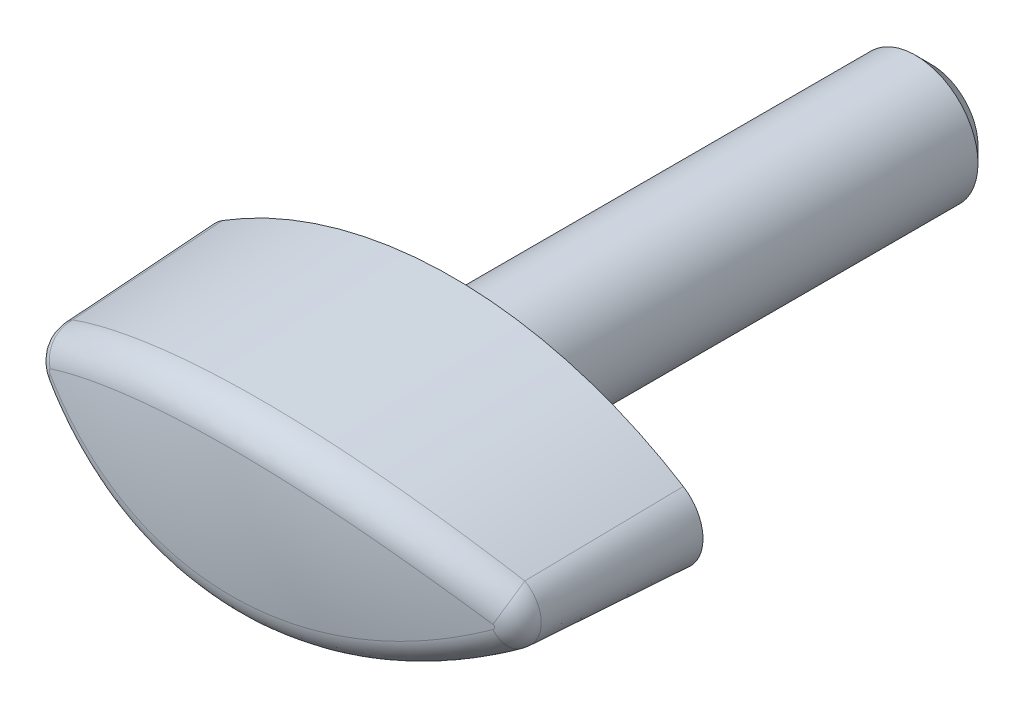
ISO-10303-21;
HEADER;
FILE_DESCRIPTION(('STEP AP214'),'2;1');
FILE_NAME('part.step','',(''),(''),'','','');
FILE_SCHEMA(('AUTOMOTIVE_DESIGN { 1 0 10303 214 1 1 1 1 }'));
ENDSEC;
DATA;
#1=APPLICATION_CONTEXT('core data for automotive mechanical design processes');
#2=APPLICATION_PROTOCOL_DEFINITION('international standard','automotive_design',2000,#1);
#3=PRODUCT_CONTEXT('',#1,'mechanical');
#4=PRODUCT('Part','Part','',(#3));
#5=PRODUCT_RELATED_PRODUCT_CATEGORY('part','',(#4));
#6=PRODUCT_DEFINITION_FORMATION('','',#4);
#7=PRODUCT_DEFINITION_CONTEXT('part definition',#1,'design');
#8=PRODUCT_DEFINITION('design','',#6,#7);
#9=PRODUCT_DEFINITION_SHAPE('','',#8);
#10=(LENGTH_UNIT() NAMED_UNIT(*) SI_UNIT(.MILLI.,.METRE.));
#11=(NAMED_UNIT(*) PLANE_ANGLE_UNIT() SI_UNIT($,.RADIAN.));
#12=(NAMED_UNIT(*) SI_UNIT($,.STERADIAN.) SOLID_ANGLE_UNIT());
#13=UNCERTAINTY_MEASURE_WITH_UNIT(LENGTH_MEASURE(1.E-05),#10,'distance_accuracy_value','');
#14=(GEOMETRIC_REPRESENTATION_CONTEXT(3) GLOBAL_UNCERTAINTY_ASSIGNED_CONTEXT((#13)) GLOBAL_UNIT_ASSIGNED_CONTEXT((#10,
#11,#12)) REPRESENTATION_CONTEXT('',''));
#15=CARTESIAN_POINT('',(0.,0.,0.));
#16=DIRECTION('',(0.,0.,1.));
#17=DIRECTION('',(1.,0.,0.));
#18=AXIS2_PLACEMENT_3D('',#15,#16,#17);
#19=CARTESIAN_POINT('',(0.,0.,0.));
#20=DIRECTION('',(0.,0.,1.));
#21=DIRECTION('',(1.,0.,0.));
#22=AXIS2_PLACEMENT_3D('',#19,#20,#21);
#23=PLANE('',#22);
#24=CARTESIAN_POINT('',(0.,0.,0.));
#25=DIRECTION('',(0.,0.,1.));
#26=DIRECTION('',(1.,0.,0.));
#27=AXIS2_PLACEMENT_3D('',#24,#25,#26);
#28=CIRCLE('',#27,5.);
#29=CARTESIAN_POINT('',(5.,0.,0.));
#30=VERTEX_POINT('',#29);
#31=EDGE_CURVE('E73',#30,#30,#28,.T.);
#32=ORIENTED_EDGE('',*,*,#31,.F.);
#33=EDGE_LOOP('',(#32));
#34=FACE_BOUND('',#33,.T.);
#35=CARTESIAN_POINT('',(0.,0.,0.));
#36=DIRECTION('',(0.,0.,1.));
#37=DIRECTION('',(1.,0.,0.));
#38=AXIS2_PLACEMENT_3D('',#35,#36,#37);
#39=CIRCLE('',#38,4.);
#40=CARTESIAN_POINT('',(4.,0.,0.));
#41=VERTEX_POINT('',#40);
#42=EDGE_CURVE('E244',#41,#41,#39,.F.);
#43=ORIENTED_EDGE('',*,*,#42,.F.);
#44=EDGE_LOOP('',(#43));
#45=FACE_BOUND('',#44,.T.);
#46=ADVANCED_FACE('F14',(#34,#45),#23,.F.);
#47=CARTESIAN_POINT('',(13.3241500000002,0.,0.6));
#48=DIRECTION('',(0.,0.,-1.));
#49=DIRECTION('',(1.,0.,0.));
#50=AXIS2_PLACEMENT_3D('',#47,#48,#49);
#51=CONICAL_SURFACE('',#50,2.67585,0.05235987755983);
#52=DIRECTION('',(0.0277113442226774,0.0443974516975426,-0.998629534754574));
#53=VECTOR('',#52,1.);
#54=CARTESIAN_POINT('',(14.740984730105,2.26996752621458,0.6));
#55=LINE('',#54,#53);
#56=CARTESIAN_POINT('',(14.4672021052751,1.83132944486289,10.4662631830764));
#57=VERTEX_POINT('',#56);
#58=CARTESIAN_POINT('',(14.740984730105,2.26996752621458,0.6));
#59=VERTEX_POINT('',#58);
#60=EDGE_CURVE('E67',#57,#59,#55,.T.);
#61=ORIENTED_EDGE('',*,*,#60,.F.);
#62=CARTESIAN_POINT('',(14.1108098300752,0.166021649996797,12.2354945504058));
#63=CARTESIAN_POINT('',(14.3791069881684,1.89963543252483,12.1178779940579));
#64=CARTESIAN_POINT('',(13.7556046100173,2.11406366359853,10.488000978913));
#65=CARTESIAN_POINT('',(14.1206757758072,0.164229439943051,12.2314837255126));
#66=CARTESIAN_POINT('',(14.4709389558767,1.84375069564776,12.0807327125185));
#67=CARTESIAN_POINT('',(13.8807542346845,2.08880404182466,10.4842046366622));
#68=CARTESIAN_POINT('',(14.1304087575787,0.161539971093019,12.2275262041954));
#69=CARTESIAN_POINT('',(14.5573909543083,1.78120267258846,12.0457616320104));
#70=CARTESIAN_POINT('',(14.0037556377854,2.05225919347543,10.4804587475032));
#71=CARTESIAN_POINT('',(14.149331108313,0.154432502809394,12.2198309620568));
#72=CARTESIAN_POINT('',(14.7174367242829,1.64606885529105,11.9810176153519));
#73=CARTESIAN_POINT('',(14.2421335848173,1.9576660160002,10.4731750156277));
#74=CARTESIAN_POINT('',(14.1585196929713,0.150012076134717,12.2160935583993));
#75=CARTESIAN_POINT('',(14.7913628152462,1.57353154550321,11.9511102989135));
#76=CARTESIAN_POINT('',(14.3574991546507,1.8995874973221,10.4696374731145));
#77=CARTESIAN_POINT('',(14.1753172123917,0.139950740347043,12.20926024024));
#78=CARTESIAN_POINT('',(14.9209668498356,1.42684806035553,11.8986754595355));
#79=CARTESIAN_POINT('',(14.5677797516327,1.76874922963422,10.4631695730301));
#80=CARTESIAN_POINT('',(14.1829939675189,0.134441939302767,12.2061368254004));
#81=CARTESIAN_POINT('',(14.9778340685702,1.3534010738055,11.8756670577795));
#82=CARTESIAN_POINT('',(14.663597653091,1.69761255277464,10.460213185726));
#83=CARTESIAN_POINT('',(14.1973956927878,0.12213486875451,12.2002765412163));
#84=CARTESIAN_POINT('',(15.0810613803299,1.20116793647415,11.8338996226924));
#85=CARTESIAN_POINT('',(14.8429330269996,1.53964661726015,10.4546662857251));
#86=CARTESIAN_POINT('',(14.2041215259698,0.115337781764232,12.1975393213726));
#87=CARTESIAN_POINT('',(15.1276484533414,1.12231233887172,11.815048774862));
#88=CARTESIAN_POINT('',(14.9264616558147,1.45283175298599,10.4520754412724));
#89=CARTESIAN_POINT('',(14.2164165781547,0.100570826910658,12.1925350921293));
#90=CARTESIAN_POINT('',(15.2105709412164,0.960026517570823,11.7814940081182));
#91=CARTESIAN_POINT('',(15.0788595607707,1.26502385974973,10.4473388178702));
#92=CARTESIAN_POINT('',(14.2219817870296,0.0925970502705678,12.1902697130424));
#93=CARTESIAN_POINT('',(15.2470602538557,0.876453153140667,11.7667278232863));
#94=CARTESIAN_POINT('',(15.1476780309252,1.16398362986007,10.445194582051));
#95=CARTESIAN_POINT('',(14.2317036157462,0.07569974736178,12.1863120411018));
#96=CARTESIAN_POINT('',(15.3095362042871,0.706031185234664,11.7414448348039));
#97=CARTESIAN_POINT('',(15.2677226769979,0.950505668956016,10.4414485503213));
#98=CARTESIAN_POINT('',(14.2358602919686,0.066776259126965,12.1846197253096));
#99=CARTESIAN_POINT('',(15.3356733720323,0.619012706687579,11.7308671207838));
#100=CARTESIAN_POINT('',(15.3189495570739,0.838068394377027,10.4398467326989));
#101=CARTESIAN_POINT('',(14.2423821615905,0.0487906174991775,12.1819643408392));
#102=CARTESIAN_POINT('',(15.3761517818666,0.447923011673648,11.7144851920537));
#103=CARTESIAN_POINT('',(15.3992531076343,0.611876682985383,10.4373333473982));
#104=CARTESIAN_POINT('',(14.2448371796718,0.0397664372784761,12.1809647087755));
#105=CARTESIAN_POINT('',(15.3911740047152,0.363819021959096,11.7084054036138));
#106=CARTESIAN_POINT('',(15.4294409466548,0.498575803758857,10.4363871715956));
#107=CARTESIAN_POINT('',(14.2482229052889,0.0213918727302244,12.1795860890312));
#108=CARTESIAN_POINT('',(15.4117646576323,0.194703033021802,11.7000719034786));
#109=CARTESIAN_POINT('',(15.4710596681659,0.268088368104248,10.4350822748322));
#110=CARTESIAN_POINT('',(14.2491542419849,0.0120416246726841,12.1792068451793));
#111=CARTESIAN_POINT('',(15.4173844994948,0.109500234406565,11.6977973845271));
#112=CARTESIAN_POINT('',(15.4824982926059,0.150903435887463,10.4347233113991));
#113=CARTESIAN_POINT('',(14.2494441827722,-0.00620208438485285,12.1790887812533));
#114=CARTESIAN_POINT('',(15.4191340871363,-0.0563876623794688,11.6970892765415));
#115=CARTESIAN_POINT('',(15.4860599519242,-0.0777237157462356,10.4346115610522));
#116=CARTESIAN_POINT('',(14.2488815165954,-0.0150942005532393,12.1793179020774));
#117=CARTESIAN_POINT('',(15.4157428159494,-0.137252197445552,11.6984618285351));
#118=CARTESIAN_POINT('',(15.4791499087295,-0.189150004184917,10.4348284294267));
#119=CARTESIAN_POINT('',(14.2463728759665,-0.0326463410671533,12.1803393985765));
#120=CARTESIAN_POINT('',(15.4005322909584,-0.298022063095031,11.7046179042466));
#121=CARTESIAN_POINT('',(15.4483205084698,-0.409237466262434,10.4357953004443));
#122=CARTESIAN_POINT('',(14.2444270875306,-0.0413063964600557,12.1811316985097));
#123=CARTESIAN_POINT('',(15.3886824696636,-0.378093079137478,11.7094137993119));
#124=CARTESIAN_POINT('',(15.4244034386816,-0.517899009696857,10.4365452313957));
#125=CARTESIAN_POINT('',(14.2392436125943,-0.05811181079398,12.1832422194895));
#126=CARTESIAN_POINT('',(15.3567481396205,-0.536043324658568,11.7223380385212));
#127=CARTESIAN_POINT('',(15.3606175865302,-0.729051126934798,10.4385428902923));
#128=CARTESIAN_POINT('',(14.2360125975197,-0.0662595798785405,12.1845577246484));
#129=CARTESIAN_POINT('',(15.3366416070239,-0.614083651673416,11.7304752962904));
#130=CARTESIAN_POINT('',(15.3208311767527,-0.831570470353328,10.4397880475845));
#131=CARTESIAN_POINT('',(14.2283768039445,-0.0818874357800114,12.1876663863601));
#132=CARTESIAN_POINT('',(15.2883129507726,-0.767675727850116,11.7500336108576));
#133=CARTESIAN_POINT('',(15.226660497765,-1.02861357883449,10.442730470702));
#134=CARTESIAN_POINT('',(14.2239716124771,-0.0893672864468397,12.1894597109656));
#135=CARTESIAN_POINT('',(15.2599944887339,-0.843356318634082,11.7614936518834));
#136=CARTESIAN_POINT('',(15.1722710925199,-1.12313451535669,10.4444278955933));
#137=CARTESIAN_POINT('',(14.2139302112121,-0.103786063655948,12.1935471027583));
#138=CARTESIAN_POINT('',(15.1939882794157,-0.994616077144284,11.7882042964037));
#139=CARTESIAN_POINT('',(15.0480588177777,-1.30585339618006,10.4482967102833));
#140=CARTESIAN_POINT('',(14.2082503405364,-0.110689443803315,12.1958589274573));
#141=CARTESIAN_POINT('',(15.155838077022,-1.07014975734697,11.8036419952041));
#142=CARTESIAN_POINT('',(14.9776871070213,-1.39362351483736,10.4504849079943));
#143=CARTESIAN_POINT('',(14.1959655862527,-0.123440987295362,12.2008584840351));
#144=CARTESIAN_POINT('',(15.0709364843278,-1.2168712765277,11.8379963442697));
#145=CARTESIAN_POINT('',(14.8251308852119,-1.55637651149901,10.4552171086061));
#146=CARTESIAN_POINT('',(14.1893618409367,-0.129290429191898,12.203545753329));
#147=CARTESIAN_POINT('',(15.024034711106,-1.2881490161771,11.8569738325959));
#148=CARTESIAN_POINT('',(14.7429609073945,-1.63137487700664,10.4577606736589));
#149=CARTESIAN_POINT('',(14.1776162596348,-0.13817907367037,12.2083247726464));
#150=CARTESIAN_POINT('',(14.9379254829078,-1.40369864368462,11.8918138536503));
#151=CARTESIAN_POINT('',(14.5964379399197,-1.74592665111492,10.4622841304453));
#152=CARTESIAN_POINT('',(14.1726684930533,-0.141523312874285,12.2103377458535));
#153=CARTESIAN_POINT('',(14.9007627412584,-1.4495731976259,11.9068495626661));
#154=CARTESIAN_POINT('',(14.5346172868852,-1.78920650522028,10.4641894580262));
#155=CARTESIAN_POINT('',(14.1588637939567,-0.149828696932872,12.2159535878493));
#156=CARTESIAN_POINT('',(14.7940855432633,-1.57068387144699,11.9500087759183));
#157=CARTESIAN_POINT('',(14.3618137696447,-1.89719077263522,10.469504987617));
#158=CARTESIAN_POINT('',(14.1497242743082,-0.154253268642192,12.2196710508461));
#159=CARTESIAN_POINT('',(14.7206446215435,-1.64302902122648,11.9797198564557));
#160=CARTESIAN_POINT('',(14.2470740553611,-1.95530528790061,10.4730236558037));
#161=CARTESIAN_POINT('',(14.1308196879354,-0.16141615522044,12.2273591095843));
#162=CARTESIAN_POINT('',(14.5609853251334,-1.77849193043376,12.0443076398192));
#163=CARTESIAN_POINT('',(14.0089448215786,-2.05058717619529,10.4803005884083));
#164=CARTESIAN_POINT('',(14.1210506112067,-0.164142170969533,12.2313313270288));
#165=CARTESIAN_POINT('',(14.4743389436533,-1.84146859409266,12.0793574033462));
#166=CARTESIAN_POINT('',(13.8854992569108,-2.08760160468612,10.4840603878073));
#167=CARTESIAN_POINT('',(14.111152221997,-0.16595885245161,12.2353553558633));
#168=CARTESIAN_POINT('',(14.3823216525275,-1.89767545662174,12.1165776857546));
#169=CARTESIAN_POINT('',(13.7599471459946,-2.11317980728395,10.4878692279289));
#170=(BOUNDED_SURFACE() B_SPLINE_SURFACE(3,2,((#62,#63,#64),(#65,#66,#67),(#68,#69,#70),(#71,
#72,#73),(#74,#75,#76),(#77,#78,#79),(#80,#81,#82),(#83,#84,#85),(#86,#87,#88),(#89,#90,#91),
(#92,#93,#94),(#95,#96,#97),(#98,#99,#100),(#101,#102,#103),(#104,#105,#106),(#107,#108,#109),
(#110,#111,#112),(#113,#114,#115),(#116,#117,#118),(#119,#120,#121),(#122,#123,#124),(#125,#126,
#127),(#128,#129,#130),(#131,#132,#133),(#134,#135,#136),(#137,#138,#139),(#140,#141,#142),
(#143,#144,#145),(#146,#147,#148),(#149,#150,#151),(#152,#153,#154),(#155,#156,#157),(#158,#159,
#160),(#161,#162,#163),(#164,#165,#166),(#167,#168,#169)),.UNSPECIFIED.,.F.,.F.,
.F.) B_SPLINE_SURFACE_WITH_KNOTS((4,2,2,2,2,2,2,2,2,2,2,2,2,2,2,2,2,4),(3,3),(0.,
0.0306443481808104,0.0613318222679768,0.0894666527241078,0.117575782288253,0.145780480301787,
0.173984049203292,0.200553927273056,0.227112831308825,0.252300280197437,0.27748434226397,
0.30253934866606,0.327603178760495,0.353711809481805,0.379788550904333,0.39765775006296,
0.428206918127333,0.458974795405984),(0.,1.),
.UNSPECIFIED.) GEOMETRIC_REPRESENTATION_ITEM() RATIONAL_B_SPLINE_SURFACE(((1.,0.751050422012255,
1.),(1.,0.758307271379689,1.),(1.,0.765328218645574,1.),(1.,0.778762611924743,1.),(1.,
0.785175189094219,1.),(1.,0.79673428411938,1.),(1.,0.801941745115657,1.),(1.,0.811605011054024,
1.),(1.,0.816061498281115,1.),(1.,0.824136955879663,1.),(1.,0.827753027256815,1.),(1.,
0.834029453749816,1.),(1.,0.836689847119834,1.),(1.,0.8408477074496,1.),(1.,0.842403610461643,
1.),(1.,0.844546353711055,1.),(1.,0.845133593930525,1.),(1.,0.845316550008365,1.),(1.,
0.844961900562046,1.),(1.,0.843376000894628,1.),(1.,0.842144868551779,1.),(1.,0.838848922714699,
1.),(1.,0.836788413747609,1.),(1.,0.831885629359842,1.),(1.,0.829043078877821,1.),(1.,
0.822508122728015,1.),(1.,0.818785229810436,1.),(1.,0.810646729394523,1.),(1.,0.806231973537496,
1.),(1.,0.798283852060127,1.),(1.,0.79491041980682,1.),(1.,0.785413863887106,1.),(1.,
0.779038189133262,1.),(1.,0.765623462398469,1.),(1.,0.758579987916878,1.),(1.,0.75130211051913,1.))) REPRESENTATION_ITEM('') SURFACE());
#171=CARTESIAN_POINT('',(13.7556046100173,2.11406366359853,10.488000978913));
#172=CARTESIAN_POINT('',(13.8807542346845,2.08880404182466,10.4842046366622));
#173=CARTESIAN_POINT('',(14.0037556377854,2.05225919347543,10.4804587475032));
#174=CARTESIAN_POINT('',(14.2421335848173,1.9576660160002,10.4731750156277));
#175=CARTESIAN_POINT('',(14.3574991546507,1.8995874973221,10.4696374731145));
#176=CARTESIAN_POINT('',(14.5677797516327,1.76874922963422,10.4631695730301));
#177=CARTESIAN_POINT('',(14.663597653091,1.69761255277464,10.460213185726));
#178=CARTESIAN_POINT('',(14.8429330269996,1.53964661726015,10.4546662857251));
#179=CARTESIAN_POINT('',(14.9264616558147,1.45283175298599,10.4520754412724));
#180=CARTESIAN_POINT('',(15.0788595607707,1.26502385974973,10.4473388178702));
#181=CARTESIAN_POINT('',(15.1476780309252,1.16398362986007,10.445194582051));
#182=CARTESIAN_POINT('',(15.2677226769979,0.950505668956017,10.4414485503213));
#183=CARTESIAN_POINT('',(15.3189495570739,0.838068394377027,10.4398467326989));
#184=CARTESIAN_POINT('',(15.3992531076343,0.611876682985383,10.4373333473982));
#185=CARTESIAN_POINT('',(15.4294409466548,0.498575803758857,10.4363871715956));
#186=CARTESIAN_POINT('',(15.4710596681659,0.268088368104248,10.4350822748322));
#187=CARTESIAN_POINT('',(15.4824982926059,0.150903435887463,10.4347233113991));
#188=CARTESIAN_POINT('',(15.4860599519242,-0.0777237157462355,10.4346115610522));
#189=CARTESIAN_POINT('',(15.4791499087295,-0.189150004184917,10.4348284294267));
#190=CARTESIAN_POINT('',(15.4483205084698,-0.409237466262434,10.4357953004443));
#191=CARTESIAN_POINT('',(15.4244034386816,-0.517899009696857,10.4365452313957));
#192=CARTESIAN_POINT('',(15.3606175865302,-0.729051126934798,10.4385428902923));
#193=CARTESIAN_POINT('',(15.3208311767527,-0.831570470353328,10.4397880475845));
#194=CARTESIAN_POINT('',(15.226660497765,-1.02861357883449,10.442730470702));
#195=CARTESIAN_POINT('',(15.1722710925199,-1.12313451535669,10.4444278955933));
#196=CARTESIAN_POINT('',(15.0480588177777,-1.30585339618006,10.4482967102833));
#197=CARTESIAN_POINT('',(14.9776871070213,-1.39362351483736,10.4504849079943));
#198=CARTESIAN_POINT('',(14.8251308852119,-1.55637651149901,10.4552171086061));
#199=CARTESIAN_POINT('',(14.7429609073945,-1.63137487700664,10.4577606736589));
#200=CARTESIAN_POINT('',(14.5964379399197,-1.74592665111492,10.4622841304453));
#201=CARTESIAN_POINT('',(14.5346172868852,-1.78920650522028,10.4641894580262));
#202=CARTESIAN_POINT('',(14.3618137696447,-1.89719077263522,10.469504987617));
#203=CARTESIAN_POINT('',(14.2470740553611,-1.95530528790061,10.4730236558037));
#204=CARTESIAN_POINT('',(14.0089448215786,-2.05058717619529,10.4803005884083));
#205=CARTESIAN_POINT('',(13.8854992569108,-2.08760160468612,10.4840603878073));
#206=CARTESIAN_POINT('',(13.7599471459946,-2.11317980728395,10.4878692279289));
#207=B_SPLINE_CURVE_WITH_KNOTS('',3,(#171,#172,#173,#174,#175,#176,#177,#178,#179,#180,#181,
#182,#183,#184,#185,#186,#187,#188,#189,#190,#191,#192,#193,#194,#195,#196,#197,#198,#199,#200,
#201,#202,#203,#204,#205,#206),.UNSPECIFIED.,.F.,.F.,(4,2,2,2,2,2,2,2,2,2,2,2,2,2,2,2,2,4),(0.,
0.0306443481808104,0.0613318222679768,0.0894666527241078,0.117575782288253,0.145780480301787,
0.173984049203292,0.200553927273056,0.227112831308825,0.252300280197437,0.27748434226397,
0.30253934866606,0.327603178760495,0.353711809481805,0.379788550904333,0.39765775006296,
0.428206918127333,0.458974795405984),.UNSPECIFIED.);
#208=CARTESIAN_POINT('',(14.4708427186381,-1.82905899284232,10.4661511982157));
#209=VERTEX_POINT('',#208);
#210=EDGE_CURVE('E37',#57,#209,#207,.T.);
#211=ORIENTED_EDGE('',*,*,#210,.T.);
#212=DIRECTION('',(0.02779952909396,-0.0443422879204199,-0.998629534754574));
#213=VECTOR('',#212,1.);
#214=CARTESIAN_POINT('',(14.7454934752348,-2.26714709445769,0.6));
#215=LINE('',#214,#213);
#216=CARTESIAN_POINT('',(14.7454934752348,-2.2671470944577,0.6));
#217=VERTEX_POINT('',#216);
#218=EDGE_CURVE('E86',#209,#217,#215,.T.);
#219=ORIENTED_EDGE('',*,*,#218,.T.);
#220=CARTESIAN_POINT('',(13.3241500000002,0.,0.6));
#221=DIRECTION('',(0.,0.,1.));
#222=DIRECTION('',(1.,0.,0.));
#223=AXIS2_PLACEMENT_3D('',#220,#221,#222);
#224=CIRCLE('',#223,2.67585);
#225=EDGE_CURVE('E81',#217,#59,#224,.T.);
#226=ORIENTED_EDGE('',*,*,#225,.T.);
#227=EDGE_LOOP('',(#61,#211,#219,#226));
#228=FACE_BOUND('',#227,.T.);
#229=ADVANCED_FACE('F85',(#228),#51,.T.);
#230=CARTESIAN_POINT('',(0.,-21.3471530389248,0.6));
#231=DIRECTION('',(0.,0.,-1.));
#232=DIRECTION('',(-1.,0.,0.));
#233=AXIS2_PLACEMENT_3D('',#230,#231,#232);
#234=CONICAL_SURFACE('',#233,27.8399894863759,0.05235987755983);
#235=DIRECTION('',(-0.0277113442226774,0.0443974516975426,-0.998629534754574));
#236=VECTOR('',#235,1.);
#237=CARTESIAN_POINT('',(-14.740984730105,2.26996752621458,0.6));
#238=LINE('',#237,#236);
#239=CARTESIAN_POINT('',(-14.4672021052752,1.83132944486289,10.4662631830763));
#240=VERTEX_POINT('',#239);
#241=CARTESIAN_POINT('',(-14.740984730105,2.26996752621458,0.6));
#242=VERTEX_POINT('',#241);
#243=EDGE_CURVE('E74',#240,#242,#238,.T.);
#244=ORIENTED_EDGE('',*,*,#243,.F.);
#245=CARTESIAN_POINT('',(-20.930406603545,-5.54084379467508,8.09552638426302));
#246=CARTESIAN_POINT('',(-21.7410431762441,-4.547930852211,7.71955722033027));
#247=CARTESIAN_POINT('',(-21.361002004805,-3.98479936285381,6.56942148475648));
#248=CARTESIAN_POINT('',(-20.7004619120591,-5.27506526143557,8.30163695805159));
#249=CARTESIAN_POINT('',(-21.5106243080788,-4.267807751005,7.92859864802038));
#250=CARTESIAN_POINT('',(-21.1269474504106,-3.71304857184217,6.76451010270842));
#251=CARTESIAN_POINT('',(-20.4639828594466,-5.01179059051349,8.50361247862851));
#252=CARTESIAN_POINT('',(-21.2736472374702,-3.99057334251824,8.13321259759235));
#253=CARTESIAN_POINT('',(-20.8861918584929,-3.44383895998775,6.95568479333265));
#254=CARTESIAN_POINT('',(-19.9779223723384,-4.49104867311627,8.89918767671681));
#255=CARTESIAN_POINT('',(-20.7855257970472,-3.44141472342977,8.53446912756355));
#256=CARTESIAN_POINT('',(-20.3912429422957,-2.91132293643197,7.33010623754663));
#257=CARTESIAN_POINT('',(-19.7283396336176,-4.23358200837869,9.09278651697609));
#258=CARTESIAN_POINT('',(-20.5343330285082,-3.16953159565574,8.73106329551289));
#259=CARTESIAN_POINT('',(-20.1370482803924,-2.648017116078,7.51335219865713));
#260=CARTESIAN_POINT('',(-18.9595965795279,-3.47081594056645,9.66106473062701));
#261=CARTESIAN_POINT('',(-19.7573480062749,-2.36110754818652,9.31014355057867));
#262=CARTESIAN_POINT('',(-19.3539579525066,-1.86790264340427,8.05124120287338));
#263=CARTESIAN_POINT('',(-18.4207642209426,-2.97552593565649,10.0229360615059));
#264=CARTESIAN_POINT('',(-19.2115942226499,-1.83598658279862,9.67881599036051));
#265=CARTESIAN_POINT('',(-18.8048845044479,-1.36128089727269,8.39376112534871));
#266=CARTESIAN_POINT('',(-17.2908790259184,-2.01786439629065,10.7116700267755));
#267=CARTESIAN_POINT('',(-18.0626793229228,-0.81734006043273,10.3825698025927));
#268=CARTESIAN_POINT('',(-17.6531688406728,-0.381598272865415,9.04566439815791));
#269=CARTESIAN_POINT('',(-16.6996961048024,-1.55558032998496,11.0384407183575));
#270=CARTESIAN_POINT('',(-17.4591825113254,-0.324431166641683,10.7170947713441));
#271=CARTESIAN_POINT('',(-17.0503931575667,0.0913734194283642,9.35496072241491));
#272=CARTESIAN_POINT('',(-15.4688973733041,-0.672564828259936,11.6542030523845));
#273=CARTESIAN_POINT('',(-16.1979631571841,0.620232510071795,11.3493931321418));
#274=CARTESIAN_POINT('',(-15.7951373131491,0.994894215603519,9.93779458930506));
#275=CARTESIAN_POINT('',(-14.8293034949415,-0.251814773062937,11.9432116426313));
#276=CARTESIAN_POINT('',(-15.5402244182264,1.0713800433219,11.6466903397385));
#277=CARTESIAN_POINT('',(-15.1426796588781,1.42546232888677,10.2113481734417));
#278=CARTESIAN_POINT('',(-13.6124946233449,0.477104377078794,12.4382223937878));
#279=CARTESIAN_POINT('',(-14.2850820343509,1.85512119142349,12.1571613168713));
#280=CARTESIAN_POINT('',(-13.901136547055,2.17145532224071,10.6798877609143));
#281=CARTESIAN_POINT('',(-13.0419564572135,0.792469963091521,12.6500870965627));
#282=CARTESIAN_POINT('',(-13.6946450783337,2.19501685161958,12.3760860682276));
#283=CARTESIAN_POINT('',(-13.3189045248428,2.49423413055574,10.880422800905));
#284=CARTESIAN_POINT('',(-11.8721076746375,1.3854487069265,13.045204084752));
#285=CARTESIAN_POINT('',(-12.4805399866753,2.83582708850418,12.7853667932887));
#286=CARTESIAN_POINT('',(-12.1249028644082,3.10119046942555,11.2544105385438));
#287=CARTESIAN_POINT('',(-11.2728009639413,1.66306696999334,13.2284602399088));
#288=CARTESIAN_POINT('',(-11.8570881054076,3.13631705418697,12.9754314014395));
#289=CARTESIAN_POINT('',(-11.5131372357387,3.38537322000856,11.4278668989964));
#290=CARTESIAN_POINT('',(-10.0497544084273,2.17658965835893,13.5651544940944));
#291=CARTESIAN_POINT('',(-10.5814304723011,3.69355654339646,13.3254494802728));
#292=CARTESIAN_POINT('',(-10.2645139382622,3.9110665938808,11.7465561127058));
#293=CARTESIAN_POINT('',(-9.42605842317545,2.41256510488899,13.718643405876));
#294=CARTESIAN_POINT('',(-9.92960151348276,3.9499601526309,13.4851771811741));
#295=CARTESIAN_POINT('',(-9.62770130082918,4.15264986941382,11.8918370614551));
#296=CARTESIAN_POINT('',(-8.15711575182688,2.84026101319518,13.9953538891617));
#297=CARTESIAN_POINT('',(-8.60031267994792,4.41576965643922,13.773759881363));
#298=CARTESIAN_POINT('',(-8.33194721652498,4.59052848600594,12.1537501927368));
#299=CARTESIAN_POINT('',(-7.51186909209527,3.03198152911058,14.1185754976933));
#300=CARTESIAN_POINT('',(-7.92330078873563,4.62478414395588,13.9023650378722));
#301=CARTESIAN_POINT('',(-7.67300579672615,4.78682388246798,12.2703824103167));
#302=CARTESIAN_POINT('',(-6.20206423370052,3.36907181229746,14.3343736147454));
#303=CARTESIAN_POINT('',(-6.54624797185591,4.99304862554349,14.1280313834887));
#304=CARTESIAN_POINT('',(-6.33530350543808,5.13196895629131,12.4746405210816));
#305=CARTESIAN_POINT('',(-5.53745046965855,3.51429011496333,14.4268500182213));
#306=CARTESIAN_POINT('',(-5.84670761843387,5.15179618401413,14.2247777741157));
#307=CARTESIAN_POINT('',(-5.65648557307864,5.28066359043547,12.5621716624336));
#308=CARTESIAN_POINT('',(-4.19571386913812,3.75546170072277,14.5800346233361));
#309=CARTESIAN_POINT('',(-4.4321676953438,5.41590302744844,14.3853044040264));
#310=CARTESIAN_POINT('',(-4.28600316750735,5.52761370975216,12.7071645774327));
#311=CARTESIAN_POINT('',(-3.51859089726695,3.8514144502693,14.6407424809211));
#312=CARTESIAN_POINT('',(-3.71782004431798,5.52100436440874,14.4489266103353));
#313=CARTESIAN_POINT('',(-3.59433855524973,5.62586864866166,12.7646260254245));
#314=CARTESIAN_POINT('',(-2.15653707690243,3.99270187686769,14.7300250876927));
#315=CARTESIAN_POINT('',(-2.27918661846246,5.67597876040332,14.5426217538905));
#316=CARTESIAN_POINT('',(-2.20299283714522,5.77054741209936,12.8491341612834));
#317=CARTESIAN_POINT('',(-1.47160152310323,4.03800422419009,14.7585793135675));
#318=CARTESIAN_POINT('',(-1.55561281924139,5.72565919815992,14.5725779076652));
#319=CARTESIAN_POINT('',(-1.50330689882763,5.81693813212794,12.8761614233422));
#320=CARTESIAN_POINT('',(-0.099695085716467,4.07721043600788,14.7832952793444));
#321=CARTESIAN_POINT('',(-0.105290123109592,5.76869686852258,14.5985331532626));
#322=CARTESIAN_POINT('',(-0.101844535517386,5.85708620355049,12.8995556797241));
#323=CARTESIAN_POINT('',(0.5872757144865,4.07111637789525,14.779458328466));
#324=CARTESIAN_POINT('',(0.62070953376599,5.76201188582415,14.5945067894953));
#325=CARTESIAN_POINT('',(0.5999318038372,5.8508456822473,12.8959239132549));
#326=CARTESIAN_POINT('',(1.93086467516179,4.0088809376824,14.7402116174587));
#327=CARTESIAN_POINT('',(2.04094432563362,5.69370033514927,14.5532952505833));
#328=CARTESIAN_POINT('',(1.97245978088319,5.78711531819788,12.8587759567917));
#329=CARTESIAN_POINT('',(2.58761241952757,3.95472063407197,14.7060516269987));
#330=CARTESIAN_POINT('',(2.73461323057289,5.63431387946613,14.5174620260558));
#331=CARTESIAN_POINT('',(2.6433445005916,5.73165413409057,12.8264427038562));
#332=CARTESIAN_POINT('',(3.89335170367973,3.79980545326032,14.6080794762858));
#333=CARTESIAN_POINT('',(4.11336288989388,5.46443501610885,14.4146710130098));
#334=CARTESIAN_POINT('',(3.97714814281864,5.57302153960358,12.7337097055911));
#335=CARTESIAN_POINT('',(4.54234318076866,3.69905019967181,14.5442670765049));
#336=CARTESIAN_POINT('',(4.79781680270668,5.35410028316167,14.3478089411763));
#337=CARTESIAN_POINT('',(4.64006700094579,5.46984974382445,12.6733097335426));
#338=CARTESIAN_POINT('',(5.82744950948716,3.45240071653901,14.3874367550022));
#339=CARTESIAN_POINT('',(6.15214016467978,5.08408369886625,14.183509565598));
#340=CARTESIAN_POINT('',(5.95268411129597,5.21729265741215,12.5248660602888));
#341=CARTESIAN_POINT('',(6.46357612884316,3.30654992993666,14.2944469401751));
#342=CARTESIAN_POINT('',(6.82145498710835,4.92469033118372,14.0862496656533));
#343=CARTESIAN_POINT('',(6.60239444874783,5.06795184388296,12.4368489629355));
#344=CARTESIAN_POINT('',(7.71921398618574,2.97165684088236,14.0798148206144));
#345=CARTESIAN_POINT('',(8.14103660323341,4.55894972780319,13.861868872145));
#346=CARTESIAN_POINT('',(7.88475364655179,4.72505955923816,12.2336944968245));
#347=CARTESIAN_POINT('',(8.3387274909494,2.78262046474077,13.9581764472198));
#348=CARTESIAN_POINT('',(8.79082047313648,4.35291539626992,13.7349435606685));
#349=CARTESIAN_POINT('',(8.51740483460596,4.53151415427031,12.1185608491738));
#350=CARTESIAN_POINT('',(9.87188364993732,2.25556965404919,13.6168535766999));
#351=CARTESIAN_POINT('',(10.3946908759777,3.7796641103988,13.3794408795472));
#352=CARTESIAN_POINT('',(10.0829301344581,3.99191937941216,11.7954905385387));
#353=CARTESIAN_POINT('',(10.7725226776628,1.89099127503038,13.378950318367));
#354=CARTESIAN_POINT('',(11.3344018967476,3.38422765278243,13.1322848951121));
#355=CARTESIAN_POINT('',(11.0024508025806,3.61868668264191,11.5703093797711));
#356=CARTESIAN_POINT('',(12.51579746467,1.07787551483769,12.8413283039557));
#357=CARTESIAN_POINT('',(13.1479104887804,2.50379946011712,12.5744407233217));
#358=CARTESIAN_POINT('',(12.781941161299,2.78635444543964,11.061437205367));
#359=CARTESIAN_POINT('',(13.3584048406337,0.629297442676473,12.541579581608));
#360=CARTESIAN_POINT('',(14.0208513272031,2.02009902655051,12.2646196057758));
#361=CARTESIAN_POINT('',(13.6418817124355,2.32721328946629,10.7777178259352));
#362=CARTESIAN_POINT('',(14.8280629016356,-0.251057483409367,11.9437238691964));
#363=CARTESIAN_POINT('',(15.5389439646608,1.07219108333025,11.647215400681));
#364=CARTESIAN_POINT('',(15.1414139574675,1.42623735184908,10.2118330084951));
#365=CARTESIAN_POINT('',(15.4663339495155,-0.670873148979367,11.6553645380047));
#366=CARTESIAN_POINT('',(16.1953342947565,0.622040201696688,11.3505835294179));
#367=CARTESIAN_POINT('',(15.79252236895,0.996625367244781,9.93889396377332));
#368=CARTESIAN_POINT('',(16.6949333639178,-1.55201673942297,11.0409438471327));
#369=CARTESIAN_POINT('',(17.454323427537,-0.320632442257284,10.7196566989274));
#370=CARTESIAN_POINT('',(17.0455363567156,0.0950195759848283,9.35732999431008));
#371=CARTESIAN_POINT('',(17.2852280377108,-2.01337336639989,10.7148563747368));
#372=CARTESIAN_POINT('',(18.0569246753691,-0.812560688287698,10.3858260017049));
#373=CARTESIAN_POINT('',(17.6474073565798,-0.377003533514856,9.0486803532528));
#374=CARTESIAN_POINT('',(18.4156488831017,-2.9708948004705,10.0263097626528));
#375=CARTESIAN_POINT('',(19.2063992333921,-1.83106388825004,9.68226181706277));
#376=CARTESIAN_POINT('',(18.7996716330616,-1.35654370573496,8.39695441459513));
#377=CARTESIAN_POINT('',(18.9557117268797,-3.46710219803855,9.66380587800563));
#378=CARTESIAN_POINT('',(19.7534125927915,-2.357165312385,9.31294056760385));
#379=CARTESIAN_POINT('',(19.349999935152,-1.86410419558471,8.05383576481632));
#380=CARTESIAN_POINT('',(19.7260881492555,-4.23127814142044,9.09451567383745));
#381=CARTESIAN_POINT('',(20.5320642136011,-3.16709587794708,8.73282122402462));
#382=CARTESIAN_POINT('',(20.1347551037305,-2.64566096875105,7.51498888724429));
#383=CARTESIAN_POINT('',(19.9761533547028,-4.48918945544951,8.90059285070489));
#384=CARTESIAN_POINT('',(20.7837454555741,-3.43945055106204,8.5358968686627));
#385=CARTESIAN_POINT('',(20.3894414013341,-2.90942161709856,7.33143626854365));
#386=CARTESIAN_POINT('',(20.4631333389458,-5.01084463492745,8.50433817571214));
#387=CARTESIAN_POINT('',(21.2727940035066,-3.98957500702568,8.13394940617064));
#388=CARTESIAN_POINT('',(20.8853269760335,-3.4428716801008,6.95637168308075));
#389=CARTESIAN_POINT('',(20.7000493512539,-5.2745879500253,8.30200711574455));
#390=CARTESIAN_POINT('',(21.5102098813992,-4.26730350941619,7.92897492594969));
#391=CARTESIAN_POINT('',(21.1265275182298,-3.71256053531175,6.76486046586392));
#392=CARTESIAN_POINT('',(20.9304066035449,-5.54084379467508,8.09552638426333));
#393=CARTESIAN_POINT('',(21.7410431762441,-4.547930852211,7.71955722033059));
#394=CARTESIAN_POINT('',(21.361002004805,-3.98479936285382,6.56942148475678));
#395=(BOUNDED_SURFACE() B_SPLINE_SURFACE(3,2,((#245,#246,#247),(#248,#249,#250),(#251,#252,
#253),(#254,#255,#256),(#257,#258,#259),(#260,#261,#262),(#263,#264,#265),(#266,#267,#268),
(#269,#270,#271),(#272,#273,#274),(#275,#276,#277),(#278,#279,#280),(#281,#282,#283),(#284,#285,
#286),(#287,#288,#289),(#290,#291,#292),(#293,#294,#295),(#296,#297,#298),(#299,#300,#301),
(#302,#303,#304),(#305,#306,#307),(#308,#309,#310),(#311,#312,#313),(#314,#315,#316),(#317,#318,
#319),(#320,#321,#322),(#323,#324,#325),(#326,#327,#328),(#329,#330,#331),(#332,#333,#334),
(#335,#336,#337),(#338,#339,#340),(#341,#342,#343),(#344,#345,#346),(#347,#348,#349),(#350,#351,
#352),(#353,#354,#355),(#356,#357,#358),(#359,#360,#361),(#362,#363,#364),(#365,#366,#367),
(#368,#369,#370),(#371,#372,#373),(#374,#375,#376),(#377,#378,#379),(#380,#381,#382),(#383,#384,
#385),(#386,#387,#388),(#389,#390,#391),(#392,#393,#394)),.UNSPECIFIED.,.F.,.F.,
.F.) B_SPLINE_SURFACE_WITH_KNOTS((4,2,2,2,2,2,2,2,2,2,2,2,2,2,2,2,2,2,2,2,2,2,2,2,4),(3,3),(0.,
1.15675494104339,2.31362523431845,4.62898987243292,6.95027863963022,9.27052199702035,
11.2149387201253,13.1590922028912,15.0998972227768,17.0406998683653,18.9877611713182,
20.9348435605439,22.8831680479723,24.8314137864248,26.7029081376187,28.5744176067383,
30.444129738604,32.3135854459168,35.1467321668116,37.9812548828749,40.2968026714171,
42.6139628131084,44.9340057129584,46.0929475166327,47.2517804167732),(0.,1.),
.UNSPECIFIED.) GEOMETRIC_REPRESENTATION_ITEM() RATIONAL_B_SPLINE_SURFACE(((1.,0.83157670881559,
1.),(1.,0.829747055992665,1.),(1.,0.827926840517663,1.),(1.,0.824311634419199,1.),(1.,
0.822516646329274,1.),(1.,0.817177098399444,1.),(1.,0.813680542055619,1.),(1.,0.806867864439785,
1.),(1.,0.803552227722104,1.),(1.,0.797173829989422,1.),(1.,0.794110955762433,1.),(1.,
0.788770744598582,1.),(1.,0.786446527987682,1.),(1.,0.782055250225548,1.),(1.,0.779988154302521,
1.),(1.,0.776148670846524,1.),(1.,0.774375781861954,1.),(1.,0.771151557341,1.),(1.,
0.769700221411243,1.),(1.,0.767141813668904,1.),(1.,0.766035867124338,1.),(1.,0.764195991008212,
1.),(1.,0.763462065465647,1.),(1.,0.762380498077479,1.),(1.,0.7620331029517,1.),(1.,
0.761732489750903,1.),(1.,0.761779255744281,1.),(1.,0.762256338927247,1.),(1.,0.762671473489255,
1.),(1.,0.763856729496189,1.),(1.,0.764626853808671,1.),(1.,0.766507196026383,1.),(1.,
0.76761708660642,1.),(1.,0.770156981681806,1.),(1.,0.771586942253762,1.),(1.,0.775557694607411,
1.),(1.,0.778291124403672,1.),(1.,0.784339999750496,1.),(1.,0.787655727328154,1.),(1.,
0.794105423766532,1.),(1.,0.797161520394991,1.),(1.,0.803526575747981,1.),(1.,0.806835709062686,
1.),(1.,0.813647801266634,1.),(1.,0.817150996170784,1.),(1.,0.82250057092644,1.),(1.,
0.824298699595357,1.),(1.,0.82792030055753,1.),(1.,0.829743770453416,1.),(1.,0.831576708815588,1.))) REPRESENTATION_ITEM('') SURFACE());
#396=CARTESIAN_POINT('',(-21.361002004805,-3.98479936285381,6.56942148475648));
#397=CARTESIAN_POINT('',(-21.1269474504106,-3.71304857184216,6.76451010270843));
#398=CARTESIAN_POINT('',(-20.8861918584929,-3.44383895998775,6.95568479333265));
#399=CARTESIAN_POINT('',(-20.3912429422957,-2.91132293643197,7.33010623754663));
#400=CARTESIAN_POINT('',(-20.1370482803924,-2.648017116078,7.51335219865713));
#401=CARTESIAN_POINT('',(-19.3539579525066,-1.86790264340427,8.05124120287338));
#402=CARTESIAN_POINT('',(-18.8048845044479,-1.36128089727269,8.39376112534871));
#403=CARTESIAN_POINT('',(-17.6531688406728,-0.381598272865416,9.04566439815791));
#404=CARTESIAN_POINT('',(-17.0503931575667,0.0913734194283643,9.35496072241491));
#405=CARTESIAN_POINT('',(-15.7951373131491,0.99489421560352,9.93779458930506));
#406=CARTESIAN_POINT('',(-15.1426796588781,1.42546232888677,10.2113481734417));
#407=CARTESIAN_POINT('',(-13.901136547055,2.17145532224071,10.6798877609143));
#408=CARTESIAN_POINT('',(-13.3189045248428,2.49423413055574,10.880422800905));
#409=CARTESIAN_POINT('',(-12.1249028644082,3.10119046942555,11.2544105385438));
#410=CARTESIAN_POINT('',(-11.5131372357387,3.38537322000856,11.4278668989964));
#411=CARTESIAN_POINT('',(-10.2645139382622,3.9110665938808,11.7465561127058));
#412=CARTESIAN_POINT('',(-9.62770130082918,4.15264986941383,11.8918370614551));
#413=CARTESIAN_POINT('',(-8.33194721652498,4.59052848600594,12.1537501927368));
#414=CARTESIAN_POINT('',(-7.67300579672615,4.78682388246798,12.2703824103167));
#415=CARTESIAN_POINT('',(-6.33530350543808,5.13196895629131,12.4746405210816));
#416=CARTESIAN_POINT('',(-5.65648557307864,5.28066359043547,12.5621716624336));
#417=CARTESIAN_POINT('',(-4.28600316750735,5.52761370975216,12.7071645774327));
#418=CARTESIAN_POINT('',(-3.59433855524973,5.62586864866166,12.7646260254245));
#419=CARTESIAN_POINT('',(-2.20299283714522,5.77054741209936,12.8491341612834));
#420=CARTESIAN_POINT('',(-1.50330689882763,5.81693813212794,12.8761614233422));
#421=CARTESIAN_POINT('',(-0.101844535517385,5.85708620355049,12.8995556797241));
#422=CARTESIAN_POINT('',(0.5999318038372,5.8508456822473,12.8959239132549));
#423=CARTESIAN_POINT('',(1.97245978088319,5.78711531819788,12.8587759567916));
#424=CARTESIAN_POINT('',(2.6433445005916,5.73165413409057,12.8264427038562));
#425=CARTESIAN_POINT('',(3.97714814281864,5.57302153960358,12.7337097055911));
#426=CARTESIAN_POINT('',(4.64006700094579,5.46984974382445,12.6733097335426));
#427=CARTESIAN_POINT('',(5.95268411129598,5.21729265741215,12.5248660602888));
#428=CARTESIAN_POINT('',(6.60239444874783,5.06795184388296,12.4368489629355));
#429=CARTESIAN_POINT('',(7.88475364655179,4.72505955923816,12.2336944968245));
#430=CARTESIAN_POINT('',(8.51740483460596,4.53151415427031,12.1185608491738));
#431=CARTESIAN_POINT('',(10.0829301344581,3.99191937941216,11.7954905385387));
#432=CARTESIAN_POINT('',(11.0024508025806,3.61868668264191,11.5703093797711));
#433=CARTESIAN_POINT('',(12.781941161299,2.78635444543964,11.061437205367));
#434=CARTESIAN_POINT('',(13.6418817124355,2.32721328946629,10.7777178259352));
#435=CARTESIAN_POINT('',(15.1414139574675,1.42623735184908,10.2118330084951));
#436=CARTESIAN_POINT('',(15.79252236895,0.996625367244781,9.93889396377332));
#437=CARTESIAN_POINT('',(17.0455363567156,0.0950195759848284,9.35732999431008));
#438=CARTESIAN_POINT('',(17.6474073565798,-0.377003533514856,9.0486803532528));
#439=CARTESIAN_POINT('',(18.7996716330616,-1.35654370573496,8.39695441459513));
#440=CARTESIAN_POINT('',(19.349999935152,-1.86410419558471,8.05383576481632));
#441=CARTESIAN_POINT('',(20.1347551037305,-2.64566096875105,7.51498888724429));
#442=CARTESIAN_POINT('',(20.3894414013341,-2.90942161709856,7.33143626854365));
#443=CARTESIAN_POINT('',(20.8853269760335,-3.4428716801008,6.95637168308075));
#444=CARTESIAN_POINT('',(21.1265275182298,-3.71256053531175,6.76486046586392));
#445=CARTESIAN_POINT('',(21.361002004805,-3.98479936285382,6.56942148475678));
#446=B_SPLINE_CURVE_WITH_KNOTS('',3,(#396,#397,#398,#399,#400,#401,#402,#403,#404,#405,#406,
#407,#408,#409,#410,#411,#412,#413,#414,#415,#416,#417,#418,#419,#420,#421,#422,#423,#424,#425,
#426,#427,#428,#429,#430,#431,#432,#433,#434,#435,#436,#437,#438,#439,#440,#441,#442,#443,#444,
#445),.UNSPECIFIED.,.F.,.F.,(4,2,2,2,2,2,2,2,2,2,2,2,2,2,2,2,2,2,2,2,2,2,2,2,4),(0.,
1.15675494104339,2.31362523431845,4.62898987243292,6.95027863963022,9.27052199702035,
11.2149387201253,13.1590922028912,15.0998972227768,17.0406998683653,18.9877611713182,
20.9348435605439,22.8831680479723,24.8314137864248,26.7029081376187,28.5744176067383,
30.444129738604,32.3135854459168,35.1467321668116,37.9812548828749,40.2968026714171,
42.6139628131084,44.9340057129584,46.0929475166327,47.2517804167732),.UNSPECIFIED.);
#447=EDGE_CURVE('E30',#240,#57,#446,.T.);
#448=ORIENTED_EDGE('',*,*,#447,.T.);
#449=ORIENTED_EDGE('',*,*,#60,.T.);
#450=CARTESIAN_POINT('',(0.,-21.3471530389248,0.6));
#451=DIRECTION('',(0.,0.,1.));
#452=DIRECTION('',(-1.,0.,0.));
#453=AXIS2_PLACEMENT_3D('',#450,#451,#452);
#454=CIRCLE('',#453,27.8399894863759);
#455=EDGE_CURVE('E70',#59,#242,#454,.T.);
#456=ORIENTED_EDGE('',*,*,#455,.T.);
#457=EDGE_LOOP('',(#244,#448,#449,#456));
#458=FACE_BOUND('',#457,.T.);
#459=ADVANCED_FACE('F69',(#458),#234,.T.);
#460=CARTESIAN_POINT('',(-13.3241500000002,0.,0.6));
#461=DIRECTION('',(0.,0.,-1.));
#462=DIRECTION('',(1.,0.,0.));
#463=AXIS2_PLACEMENT_3D('',#460,#461,#462);
#464=CONICAL_SURFACE('',#463,2.67585,0.05235987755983);
#465=DIRECTION('',(-0.02779952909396,-0.0443422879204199,-0.998629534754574));
#466=VECTOR('',#465,1.);
#467=CARTESIAN_POINT('',(-14.7454934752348,-2.2671470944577,0.6));
#468=LINE('',#467,#466);
#469=CARTESIAN_POINT('',(-14.470842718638,-1.82905899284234,10.4661511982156));
#470=VERTEX_POINT('',#469);
#471=CARTESIAN_POINT('',(-14.7454934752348,-2.26714709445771,0.6));
#472=VERTEX_POINT('',#471);
#473=EDGE_CURVE('E107',#470,#472,#468,.T.);
#474=ORIENTED_EDGE('',*,*,#473,.F.);
#475=CARTESIAN_POINT('',(-14.111152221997,-0.16595885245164,12.2353553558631));
#476=CARTESIAN_POINT('',(-14.3823216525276,-1.89767545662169,12.1165776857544));
#477=CARTESIAN_POINT('',(-13.7599471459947,-2.11317980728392,10.4878692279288));
#478=CARTESIAN_POINT('',(-14.1210125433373,-0.164146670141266,12.2313468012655));
#479=CARTESIAN_POINT('',(-14.4739846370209,-1.84166140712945,12.079500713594));
#480=CARTESIAN_POINT('',(-13.8850154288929,-2.08766924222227,10.4840750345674));
#481=CARTESIAN_POINT('',(-14.1307383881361,-0.161437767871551,12.2273921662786));
#482=CARTESIAN_POINT('',(-14.5602693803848,-1.77900246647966,12.0445972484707));
#483=CARTESIAN_POINT('',(-14.0079170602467,-2.05088202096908,10.4803318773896));
#484=CARTESIAN_POINT('',(-14.1496435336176,-0.154292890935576,12.219703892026));
#485=CARTESIAN_POINT('',(-14.7199907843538,-1.64367787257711,11.9799843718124));
#486=CARTESIAN_POINT('',(-14.2460605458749,-1.9558251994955,10.4730547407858));
#487=CARTESIAN_POINT('',(-14.1588220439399,-0.14985448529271,12.215970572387));
#488=CARTESIAN_POINT('',(-14.7937592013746,-1.57105955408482,11.950140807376));
#489=CARTESIAN_POINT('',(-14.3612913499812,-1.89752536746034,10.4695210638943));
#490=CARTESIAN_POINT('',(-14.1755957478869,-0.139761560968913,12.2091469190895));
#491=CARTESIAN_POINT('',(-14.9230565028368,-1.42425839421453,11.8978300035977));
#492=CARTESIAN_POINT('',(-14.5712596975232,-1.76630134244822,10.4630623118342));
#493=CARTESIAN_POINT('',(-14.1832591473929,-0.134239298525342,12.2060289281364));
#494=CARTESIAN_POINT('',(-14.9797757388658,-1.35077369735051,11.8748814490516));
#495=CARTESIAN_POINT('',(-14.6669048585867,-1.69500184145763,10.4601110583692));
#496=CARTESIAN_POINT('',(-14.1976322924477,-0.12190790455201,12.2001802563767));
#497=CARTESIAN_POINT('',(-15.082718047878,-1.1984835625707,11.8332292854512));
#498=CARTESIAN_POINT('',(-14.8458739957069,-1.53674349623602,10.4545751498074));
#499=CARTESIAN_POINT('',(-14.2043429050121,-0.115099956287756,12.1974492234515));
#500=CARTESIAN_POINT('',(-15.1291674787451,-1.11960817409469,11.8144341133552));
#501=CARTESIAN_POINT('',(-14.9292091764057,-1.4497990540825,10.4519901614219));
#502=CARTESIAN_POINT('',(-14.2166059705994,-0.100314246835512,12.1924580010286));
#503=CARTESIAN_POINT('',(-15.2118238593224,-0.95729843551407,11.7809869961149));
#504=CARTESIAN_POINT('',(-15.0812034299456,-1.26176895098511,10.4472658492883));
#505=CARTESIAN_POINT('',(-14.2221544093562,-0.0923325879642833,12.1901994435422));
#506=CARTESIAN_POINT('',(-15.2481840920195,-0.873720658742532,11.7662730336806));
#507=CARTESIAN_POINT('',(-15.149811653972,-1.16063622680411,10.4451280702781));
#508=CARTESIAN_POINT('',(-14.2318417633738,-0.0754229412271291,12.1862557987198));
#509=CARTESIAN_POINT('',(-15.3104108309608,-0.703304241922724,11.741090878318));
#510=CARTESIAN_POINT('',(-15.26942634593,-0.94701496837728,10.4413953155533));
#511=CARTESIAN_POINT('',(-14.2359807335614,-0.0664949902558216,12.1845706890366));
#512=CARTESIAN_POINT('',(-15.3364272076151,-0.616295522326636,11.730562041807));
#513=CARTESIAN_POINT('',(-15.3204334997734,-0.834526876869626,10.4398003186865));
#514=CARTESIAN_POINT('',(-14.2424682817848,-0.0485036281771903,12.1819292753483));
#515=CARTESIAN_POINT('',(-15.3766810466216,-0.445231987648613,11.7142709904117));
#516=CARTESIAN_POINT('',(-15.400312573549,-0.608271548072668,10.4373001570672));
#517=CARTESIAN_POINT('',(-14.2449065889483,-0.039477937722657,12.1809364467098));
#518=CARTESIAN_POINT('',(-15.3915978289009,-0.361143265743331,11.7082338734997));
#519=CARTESIAN_POINT('',(-15.4302943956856,-0.494954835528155,10.4363604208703));
#520=CARTESIAN_POINT('',(-14.2482592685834,-0.0211036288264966,12.1795712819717));
#521=CARTESIAN_POINT('',(-15.4119845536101,-0.19206902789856,11.6999829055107));
#522=CARTESIAN_POINT('',(-15.4715064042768,-0.264474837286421,10.4350682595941));
#523=CARTESIAN_POINT('',(-14.2491742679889,-0.0117551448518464,12.1791986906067));
#524=CARTESIAN_POINT('',(-15.4175053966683,-0.10689278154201,11.6977484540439));
#525=CARTESIAN_POINT('',(-15.4827443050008,-0.147313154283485,10.4347155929));
#526=CARTESIAN_POINT('',(-14.2494335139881,0.0064840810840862,12.1790931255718));
#527=CARTESIAN_POINT('',(-15.4190697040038,0.058951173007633,11.6971153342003));
#528=CARTESIAN_POINT('',(-15.485928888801,0.0812574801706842,10.4346156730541));
#529=CARTESIAN_POINT('',(-14.2488561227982,0.0153736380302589,12.1793282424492));
#530=CARTESIAN_POINT('',(-15.4155895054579,0.139798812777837,11.6985238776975));
#531=CARTESIAN_POINT('',(-15.4788379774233,0.192652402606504,10.4348382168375));
#532=CARTESIAN_POINT('',(-14.2463190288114,0.0329181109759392,12.1803613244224));
#533=CARTESIAN_POINT('',(-15.4002047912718,0.30052635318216,11.7047504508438));
#534=CARTESIAN_POINT('',(-15.4476586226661,0.412646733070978,10.435816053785));
#535=CARTESIAN_POINT('',(-14.2443595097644,0.041573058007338,12.1811592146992));
#536=CARTESIAN_POINT('',(-15.3882693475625,0.380571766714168,11.7095809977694));
#537=CARTESIAN_POINT('',(-15.4235724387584,0.521246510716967,10.4365712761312));
#538=CARTESIAN_POINT('',(-14.2391494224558,0.0583683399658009,12.1832805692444));
#539=CARTESIAN_POINT('',(-15.3561638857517,0.538484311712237,11.7225744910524));
#540=CARTESIAN_POINT('',(-15.359457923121,0.732277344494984,10.4385791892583));
#541=CARTESIAN_POINT('',(-14.2359051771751,0.0665109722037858,12.1846014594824));
#542=CARTESIAN_POINT('',(-15.3359693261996,0.616511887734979,11.7307473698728));
#543=CARTESIAN_POINT('',(-15.319507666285,0.834735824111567,10.4398294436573));
#544=CARTESIAN_POINT('',(-14.2282440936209,0.0821264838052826,12.1877204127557));
#545=CARTESIAN_POINT('',(-15.2874641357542,0.770070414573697,11.7503771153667));
#546=CARTESIAN_POINT('',(-15.2250224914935,1.0316320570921,10.4427816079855));
#547=CARTESIAN_POINT('',(-14.2238268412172,0.0895991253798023,12.1895186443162));
#548=CARTESIAN_POINT('',(-15.2590568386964,0.845729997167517,11.7618730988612));
#549=CARTESIAN_POINT('',(-15.1704824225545,1.12606696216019,10.4444836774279));
#550=CARTESIAN_POINT('',(-14.2137612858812,0.104002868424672,12.1936158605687));
#551=CARTESIAN_POINT('',(-15.1928617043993,0.996953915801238,11.7886601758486));
#552=CARTESIAN_POINT('',(-15.0459668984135,1.3086067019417,10.4483617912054));
#553=CARTESIAN_POINT('',(-14.2080691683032,0.110898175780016,12.1959326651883));
#554=CARTESIAN_POINT('',(-15.154609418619,1.07247135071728,11.8041391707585));
#555=CARTESIAN_POINT('',(-14.9754405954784,1.39628070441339,10.4505547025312));
#556=CARTESIAN_POINT('',(-14.1957613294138,0.123631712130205,12.2009416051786));
#557=CARTESIAN_POINT('',(-15.0694987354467,1.21914960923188,11.8385780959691));
#558=CARTESIAN_POINT('',(-14.8225909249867,1.55881794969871,10.4552957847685));
#559=CARTESIAN_POINT('',(-14.189146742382,0.12947121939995,12.2036332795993));
#560=CARTESIAN_POINT('',(-15.0224895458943,1.29040002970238,11.857599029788));
#561=CARTESIAN_POINT('',(-14.74028204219,1.63369667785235,10.45784351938));
#562=CARTESIAN_POINT('',(-14.1773697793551,0.138352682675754,12.2084250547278));
#563=CARTESIAN_POINT('',(-14.936088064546,1.40603579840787,11.8925572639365));
#564=CARTESIAN_POINT('',(-14.593359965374,1.74816987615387,10.4623790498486));
#565=CARTESIAN_POINT('',(-14.1724000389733,0.141698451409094,12.2104469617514));
#566=CARTESIAN_POINT('',(-14.8987295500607,1.45201881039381,11.9076721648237));
#567=CARTESIAN_POINT('',(-14.5312610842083,1.79147617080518,10.4642928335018));
#568=CARTESIAN_POINT('',(-14.1585614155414,0.149986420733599,12.2160765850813));
#569=CARTESIAN_POINT('',(-14.791689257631,1.57315694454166,11.9509782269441));
#570=CARTESIAN_POINT('',(-14.3580212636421,1.89925456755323,10.469621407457));
#571=CARTESIAN_POINT('',(-14.1494117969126,0.154393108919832,12.219798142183));
#572=CARTESIAN_POINT('',(-14.7180908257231,1.64542185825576,11.9807529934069));
#573=CARTESIAN_POINT('',(-14.2431465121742,1.95714897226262,10.4731439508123));
#574=CARTESIAN_POINT('',(-14.1304899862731,0.161518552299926,12.2274931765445));
#575=CARTESIAN_POINT('',(-14.5581071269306,1.7806938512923,12.0454719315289));
#576=CARTESIAN_POINT('',(-14.0047825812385,2.05196680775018,10.4804274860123));
#577=CARTESIAN_POINT('',(-14.1207138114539,0.16422501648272,12.2314682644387));
#578=CARTESIAN_POINT('',(-14.4712934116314,1.84355858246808,12.0805893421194));
#579=CARTESIAN_POINT('',(-13.8812376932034,2.08873737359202,10.484190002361));
#580=CARTESIAN_POINT('',(-14.1108098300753,0.166021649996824,12.2354945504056));
#581=CARTESIAN_POINT('',(-14.3791069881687,1.89963543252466,12.1178779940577));
#582=CARTESIAN_POINT('',(-13.7556046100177,2.11406366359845,10.4880009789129));
#583=(BOUNDED_SURFACE() B_SPLINE_SURFACE(3,2,((#475,#476,#477),(#478,#479,#480),(#481,#482,
#483),(#484,#485,#486),(#487,#488,#489),(#490,#491,#492),(#493,#494,#495),(#496,#497,#498),
(#499,#500,#501),(#502,#503,#504),(#505,#506,#507),(#508,#509,#510),(#511,#512,#513),(#514,#515,
#516),(#517,#518,#519),(#520,#521,#522),(#523,#524,#525),(#526,#527,#528),(#529,#530,#531),
(#532,#533,#534),(#535,#536,#537),(#538,#539,#540),(#541,#542,#543),(#544,#545,#546),(#547,#548,
#549),(#550,#551,#552),(#553,#554,#555),(#556,#557,#558),(#559,#560,#561),(#562,#563,#564),
(#565,#566,#567),(#568,#569,#570),(#571,#572,#573),(#574,#575,#576),(#577,#578,#579),(#580,#581,
#582)),.UNSPECIFIED.,.F.,.F.,.F.) B_SPLINE_SURFACE_WITH_KNOTS((4,2,2,2,2,2,2,2,2,2,2,2,2,2,2,2,
2,4),(3,3),(0.,0.0306369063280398,0.0613170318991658,0.0894390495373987,0.117535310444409,
0.145727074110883,0.173917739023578,0.200477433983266,0.227026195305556,0.252209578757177,
0.277389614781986,0.302447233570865,0.327513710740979,0.353630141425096,0.379714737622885,
0.397643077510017,0.428199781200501,0.458974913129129),(0.,1.),
.UNSPECIFIED.) GEOMETRIC_REPRESENTATION_ITEM() RATIONAL_B_SPLINE_SURFACE(((1.,0.751302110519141,
1.),(1.,0.758551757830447,1.),(1.,0.765564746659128,1.),(1.,0.778981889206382,1.),(1.,
0.785385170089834,1.),(1.,0.796924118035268,1.),(1.,0.802120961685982,1.),(1.,0.811762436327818,
1.),(1.,0.816207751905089,1.),(1.,0.824260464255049,1.),(1.,0.827864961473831,1.),(1.,
0.834118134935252,1.),(1.,0.836766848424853,1.),(1.,0.840902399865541,1.),(1.,0.842447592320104,
1.),(1.,0.844569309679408,1.),(1.,0.845146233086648,1.),(1.,0.845309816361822,1.),(1.,
0.844945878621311,1.),(1.,0.843341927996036,1.),(1.,0.842102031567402,1.),(1.,0.838788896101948,
1.),(1.,0.836719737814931,1.),(1.,0.831800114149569,1.),(1.,0.828949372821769,1.),(1.,
0.822397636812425,1.),(1.,0.818666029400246,1.),(1.,0.810510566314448,1.),(1.,0.80608755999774,
1.),(1.,0.798116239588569,1.),(1.,0.794726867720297,1.),(1.,0.785203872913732,1.),(1.,
0.778818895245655,1.),(1.,0.765386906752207,1.),(1.,0.758335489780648,1.),(1.,0.751050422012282,1.))) REPRESENTATION_ITEM('') SURFACE());
#584=CARTESIAN_POINT('',(-13.7599471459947,-2.11317980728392,10.4878692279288));
#585=CARTESIAN_POINT('',(-13.8850154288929,-2.08766924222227,10.4840750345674));
#586=CARTESIAN_POINT('',(-14.0079170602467,-2.05088202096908,10.4803318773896));
#587=CARTESIAN_POINT('',(-14.2460605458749,-1.9558251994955,10.4730547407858));
#588=CARTESIAN_POINT('',(-14.3612913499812,-1.89752536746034,10.4695210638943));
#589=CARTESIAN_POINT('',(-14.5712596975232,-1.76630134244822,10.4630623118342));
#590=CARTESIAN_POINT('',(-14.6669048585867,-1.69500184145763,10.4601110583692));
#591=CARTESIAN_POINT('',(-14.8458739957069,-1.53674349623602,10.4545751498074));
#592=CARTESIAN_POINT('',(-14.9292091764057,-1.4497990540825,10.4519901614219));
#593=CARTESIAN_POINT('',(-15.0812034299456,-1.26176895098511,10.4472658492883));
#594=CARTESIAN_POINT('',(-15.149811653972,-1.16063622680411,10.4451280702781));
#595=CARTESIAN_POINT('',(-15.26942634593,-0.94701496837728,10.4413953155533));
#596=CARTESIAN_POINT('',(-15.3204334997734,-0.834526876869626,10.4398003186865));
#597=CARTESIAN_POINT('',(-15.400312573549,-0.608271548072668,10.4373001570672));
#598=CARTESIAN_POINT('',(-15.4302943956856,-0.494954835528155,10.4363604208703));
#599=CARTESIAN_POINT('',(-15.4715064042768,-0.264474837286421,10.4350682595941));
#600=CARTESIAN_POINT('',(-15.4827443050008,-0.147313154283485,10.4347155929));
#601=CARTESIAN_POINT('',(-15.485928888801,0.0812574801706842,10.4346156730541));
#602=CARTESIAN_POINT('',(-15.4788379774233,0.192652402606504,10.4348382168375));
#603=CARTESIAN_POINT('',(-15.4476586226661,0.412646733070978,10.435816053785));
#604=CARTESIAN_POINT('',(-15.4235724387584,0.521246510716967,10.4365712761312));
#605=CARTESIAN_POINT('',(-15.359457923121,0.732277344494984,10.4385791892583));
#606=CARTESIAN_POINT('',(-15.319507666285,0.834735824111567,10.4398294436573));
#607=CARTESIAN_POINT('',(-15.2250224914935,1.0316320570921,10.4427816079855));
#608=CARTESIAN_POINT('',(-15.1704824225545,1.12606696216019,10.4444836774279));
#609=CARTESIAN_POINT('',(-15.0459668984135,1.3086067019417,10.4483617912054));
#610=CARTESIAN_POINT('',(-14.9754405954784,1.39628070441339,10.4505547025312));
#611=CARTESIAN_POINT('',(-14.8225909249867,1.55881794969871,10.4552957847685));
#612=CARTESIAN_POINT('',(-14.74028204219,1.63369667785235,10.45784351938));
#613=CARTESIAN_POINT('',(-14.593359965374,1.74816987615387,10.4623790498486));
#614=CARTESIAN_POINT('',(-14.5312610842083,1.79147617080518,10.4642928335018));
#615=CARTESIAN_POINT('',(-14.3580212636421,1.89925456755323,10.469621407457));
#616=CARTESIAN_POINT('',(-14.2431465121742,1.95714897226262,10.4731439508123));
#617=CARTESIAN_POINT('',(-14.0047825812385,2.05196680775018,10.4804274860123));
#618=CARTESIAN_POINT('',(-13.8812376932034,2.08873737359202,10.484190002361));
#619=CARTESIAN_POINT('',(-13.7556046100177,2.11406366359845,10.4880009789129));
#620=B_SPLINE_CURVE_WITH_KNOTS('',3,(#584,#585,#586,#587,#588,#589,#590,#591,#592,#593,#594,
#595,#596,#597,#598,#599,#600,#601,#602,#603,#604,#605,#606,#607,#608,#609,#610,#611,#612,#613,
#614,#615,#616,#617,#618,#619),.UNSPECIFIED.,.F.,.F.,(4,2,2,2,2,2,2,2,2,2,2,2,2,2,2,2,2,4),(0.,
0.0306369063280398,0.0613170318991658,0.0894390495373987,0.117535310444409,0.145727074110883,
0.173917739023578,0.200477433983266,0.227026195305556,0.252209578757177,0.277389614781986,
0.302447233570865,0.327513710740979,0.353630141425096,0.379714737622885,0.397643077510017,
0.428199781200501,0.458974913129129),.UNSPECIFIED.);
#621=EDGE_CURVE('E211',#470,#240,#620,.T.);
#622=ORIENTED_EDGE('',*,*,#621,.T.);
#623=ORIENTED_EDGE('',*,*,#243,.T.);
#624=CARTESIAN_POINT('',(-13.3241500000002,0.,0.6));
#625=DIRECTION('',(0.,0.,1.));
#626=DIRECTION('',(1.,0.,0.));
#627=AXIS2_PLACEMENT_3D('',#624,#625,#626);
#628=CIRCLE('',#627,2.67585);
#629=EDGE_CURVE('E83',#242,#472,#628,.T.);
#630=ORIENTED_EDGE('',*,*,#629,.T.);
#631=EDGE_LOOP('',(#474,#622,#623,#630));
#632=FACE_BOUND('',#631,.T.);
#633=ADVANCED_FACE('F217',(#632),#464,.T.);
#634=CARTESIAN_POINT('',(0.,21.2529965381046,0.6));
#635=DIRECTION('',(0.,0.,-1.));
#636=DIRECTION('',(1.,0.,0.));
#637=AXIS2_PLACEMENT_3D('',#634,#635,#636);
#638=CONICAL_SURFACE('',#637,27.7601645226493,0.05235987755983);
#639=ORIENTED_EDGE('',*,*,#218,.F.);
#640=CARTESIAN_POINT('',(20.9050060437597,5.54532875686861,8.11212957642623));
#641=CARTESIAN_POINT('',(21.7174475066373,4.55531908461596,7.73542153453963));
#642=CARTESIAN_POINT('',(21.3399844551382,3.99277493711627,6.58513680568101));
#643=CARTESIAN_POINT('',(20.676076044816,5.27938420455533,8.31731061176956));
#644=CARTESIAN_POINT('',(21.4880466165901,4.27500771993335,7.94353533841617));
#645=CARTESIAN_POINT('',(21.1069121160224,3.72079448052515,6.77934559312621));
#646=CARTESIAN_POINT('',(20.4406185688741,5.01594720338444,8.51838499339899));
#647=CARTESIAN_POINT('',(21.2520919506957,3.99758864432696,8.14725170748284));
#648=CARTESIAN_POINT('',(20.8671443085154,3.45135943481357,6.96966733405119));
#649=CARTESIAN_POINT('',(19.9566154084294,4.49488377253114,8.91221504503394));
#650=CARTESIAN_POINT('',(20.7660305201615,3.44806434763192,8.54676773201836));
#651=CARTESIAN_POINT('',(20.3741824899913,2.91839687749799,7.34243695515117));
#652=CARTESIAN_POINT('',(19.7080684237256,4.23725792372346,9.10496988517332));
#653=CARTESIAN_POINT('',(20.5158754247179,3.1760001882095,8.74251933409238));
#654=CARTESIAN_POINT('',(20.1209871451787,2.65486995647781,7.5248840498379));
#655=CARTESIAN_POINT('',(18.9424567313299,3.47401354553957,9.67080065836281));
#656=CARTESIAN_POINT('',(19.7420383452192,2.36703379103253,9.31914619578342));
#657=CARTESIAN_POINT('',(19.3409148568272,1.874093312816,8.06045649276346));
#658=CARTESIAN_POINT('',(18.4057415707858,2.97840260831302,10.0311553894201));
#659=CARTESIAN_POINT('',(19.1984094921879,1.84154871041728,9.68630048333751));
#660=CARTESIAN_POINT('',(18.7938777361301,1.36703064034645,8.40154091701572));
#661=CARTESIAN_POINT('',(17.2801500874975,2.02006402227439,10.7170899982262));
#662=CARTESIAN_POINT('',(18.0538112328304,0.822138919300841,10.3872431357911));
#663=CARTESIAN_POINT('',(17.6462833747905,0.386437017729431,9.05079453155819));
#664=CARTESIAN_POINT('',(16.6911440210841,1.55742360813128,11.0425786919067));
#665=CARTESIAN_POINT('',(17.4525055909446,0.328829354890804,10.7204794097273));
#666=CARTESIAN_POINT('',(17.0455929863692,-0.0870049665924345,9.35887741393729));
#667=CARTESIAN_POINT('',(15.4647399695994,0.673629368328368,11.6560252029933));
#668=CARTESIAN_POINT('',(16.1957186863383,-0.616703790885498,11.3504424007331));
#669=CARTESIAN_POINT('',(15.7945383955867,-0.991524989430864,9.93951929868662));
#670=CARTESIAN_POINT('',(14.8273638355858,0.252457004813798,11.9439998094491));
#671=CARTESIAN_POINT('',(15.5402190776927,-1.06832180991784,11.6466965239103));
#672=CARTESIAN_POINT('',(15.1441966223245,-1.42262195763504,10.2120941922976));
#673=CARTESIAN_POINT('',(13.6144082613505,-0.4774699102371,12.4374446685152));
#674=CARTESIAN_POINT('',(14.2889658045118,-1.85317589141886,12.1555871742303));
#675=CARTESIAN_POINT('',(13.9063053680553,-2.16981425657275,10.6791516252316));
#676=CARTESIAN_POINT('',(13.0454878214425,-0.793392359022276,12.6487272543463));
#677=CARTESIAN_POINT('',(13.7001600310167,-2.19368449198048,12.3739252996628));
#678=CARTESIAN_POINT('',(13.3255926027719,-2.49323585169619,10.8791356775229));
#679=CARTESIAN_POINT('',(11.878856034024,-1.38752516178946,13.0428373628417));
#680=CARTESIAN_POINT('',(12.4893007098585,-2.83576538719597,12.7821905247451));
#681=CARTESIAN_POINT('',(12.1346036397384,-3.10151067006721,11.2521703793));
#682=CARTESIAN_POINT('',(11.2811485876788,-1.66574060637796,13.2256687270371));
#683=CARTESIAN_POINT('',(11.8674609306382,-3.13691358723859,12.971827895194));
#684=CARTESIAN_POINT('',(11.5243314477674,-3.38636909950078,11.4252246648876));
#685=CARTESIAN_POINT('',(10.0612672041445,-2.18050261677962,13.5616744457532));
#686=CARTESIAN_POINT('',(10.5949943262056,-3.6955197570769,13.3211546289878));
#687=CARTESIAN_POINT('',(10.2786549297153,-3.91345047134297,11.7432621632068));
#688=CARTESIAN_POINT('',(9.43913707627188,-2.41711996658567,13.7148992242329));
#689=CARTESIAN_POINT('',(9.94474128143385,-3.95263187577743,13.4806192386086));
#690=CARTESIAN_POINT('',(9.64329559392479,-4.15574583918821,11.8882931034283));
#691=CARTESIAN_POINT('',(8.17328674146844,-2.8461461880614,13.9912422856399));
#692=CARTESIAN_POINT('',(8.61856304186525,-4.41991057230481,13.7688401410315));
#693=CARTESIAN_POINT('',(8.35040247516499,-4.59508619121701,12.1498584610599));
#694=CARTESIAN_POINT('',(7.52956656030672,-3.0385551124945,14.1143606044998));
#695=CARTESIAN_POINT('',(7.94308247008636,-4.62968572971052,13.8973476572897));
#696=CARTESIAN_POINT('',(7.69286871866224,-4.79213122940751,12.2663929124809));
#697=CARTESIAN_POINT('',(6.22276774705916,-3.3770702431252,14.3301139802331));
#698=CARTESIAN_POINT('',(6.56904081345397,-4.99952533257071,14.1229853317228));
#699=CARTESIAN_POINT('',(6.35792888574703,-5.1388141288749,12.4706086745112));
#700=CARTESIAN_POINT('',(5.55963336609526,-3.52302508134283,14.422649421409));
#701=CARTESIAN_POINT('',(5.8709764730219,-5.15908700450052,14.2198018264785));
#702=CARTESIAN_POINT('',(5.68046554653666,-5.28829701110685,12.5581956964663));
#703=CARTESIAN_POINT('',(4.22079235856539,-3.76571142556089,14.576114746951));
#704=CARTESIAN_POINT('',(4.45931785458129,-5.42486828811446,14.3806368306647));
#705=CARTESIAN_POINT('',(4.31262439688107,-5.5368549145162,12.703454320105));
#706=CARTESIAN_POINT('',(3.54508559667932,-3.86244240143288,14.6370442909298));
#707=CARTESIAN_POINT('',(3.74637181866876,-5.53082904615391,14.4444974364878));
#708=CARTESIAN_POINT('',(3.62224644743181,-5.63592939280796,12.761125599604));
#709=CARTESIAN_POINT('',(2.18579315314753,-4.00532107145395,14.7269316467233));
#710=CARTESIAN_POINT('',(2.31046020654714,-5.68755977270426,14.5388364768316));
#711=CARTESIAN_POINT('',(2.23339915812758,-5.78227106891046,12.8462061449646));
#712=CARTESIAN_POINT('',(1.50220274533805,-4.05143663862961,14.7558691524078));
#713=CARTESIAN_POINT('',(1.58820308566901,-5.73813596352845,14.569197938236));
#714=CARTESIAN_POINT('',(1.53492496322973,-5.82950536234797,12.8735961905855));
#715=CARTESIAN_POINT('',(0.132902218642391,-4.09229415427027,14.7815109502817));
#716=CARTESIAN_POINT('',(0.140416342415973,-5.78299001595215,14.5961283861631));
#717=CARTESIAN_POINT('',(0.13579890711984,-5.87135399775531,12.8978667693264));
#718=CARTESIAN_POINT('',(-0.552807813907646,-4.08703816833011,14.7782165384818));
#719=CARTESIAN_POINT('',(-0.584367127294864,-5.77722387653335,14.592670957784));
#720=CARTESIAN_POINT('',(-0.564852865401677,-5.86597045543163,12.8947485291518));
#721=CARTESIAN_POINT('',(-1.89394621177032,-4.02646090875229,14.7401880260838));
#722=CARTESIAN_POINT('',(-2.00224881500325,-5.71072593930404,14.5527337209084));
#723=CARTESIAN_POINT('',(-1.93519747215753,-5.80392386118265,12.8587536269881));
#724=CARTESIAN_POINT('',(-2.54950092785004,-3.97312519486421,14.7067007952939));
#725=CARTESIAN_POINT('',(-2.69477989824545,-5.65223744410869,14.5176016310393));
#726=CARTESIAN_POINT('',(-2.60502009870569,-5.74929452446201,12.8270571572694));
#727=CARTESIAN_POINT('',(-3.85294450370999,-3.81986741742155,14.6102200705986));
#728=CARTESIAN_POINT('',(-4.0713586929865,-5.48415724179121,14.4163617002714));
#729=CARTESIAN_POINT('',(-3.93679047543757,-5.59232303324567,12.7357358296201));
#730=CARTESIAN_POINT('',(-4.50083331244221,-3.71994504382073,14.5472263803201));
#731=CARTESIAN_POINT('',(-4.75478134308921,-5.3747213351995,14.350347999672));
#732=CARTESIAN_POINT('',(-4.59873817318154,-5.48998056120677,12.6761107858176));
#733=CARTESIAN_POINT('',(-5.78383639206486,-3.47495260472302,14.3921729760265));
#734=CARTESIAN_POINT('',(-6.10715893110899,-5.10648464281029,14.1878860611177));
#735=CARTESIAN_POINT('',(-5.90951464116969,-5.23906249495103,12.5293490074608));
#736=CARTESIAN_POINT('',(-6.41896223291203,-3.32992559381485,14.3001409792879));
#737=CARTESIAN_POINT('',(-6.77556008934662,-4.94797002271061,14.0916129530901));
#738=CARTESIAN_POINT('',(-6.55835529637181,-5.09053099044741,12.4422385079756));
#739=CARTESIAN_POINT('',(-7.67269500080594,-2.99665755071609,14.087559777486));
#740=CARTESIAN_POINT('',(-8.09342362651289,-4.58395230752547,13.8693403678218));
#741=CARTESIAN_POINT('',(-7.83907014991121,-4.74922402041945,12.2410252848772));
#742=CARTESIAN_POINT('',(-8.29130409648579,-2.80842222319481,13.9670143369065));
#743=CARTESIAN_POINT('',(-8.74240334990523,-4.37876017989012,13.7435342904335));
#744=CARTESIAN_POINT('',(-8.47094657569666,-4.55645439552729,12.1269261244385));
#745=CARTESIAN_POINT('',(-9.8327862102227,-2.27973915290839,13.626286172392));
#746=CARTESIAN_POINT('',(-10.3553075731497,-3.80366082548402,13.3886003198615));
#747=CARTESIAN_POINT('',(-10.0453448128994,-4.01506388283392,11.8044187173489));
#748=CARTESIAN_POINT('',(-10.7421972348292,-1.91162341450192,13.387233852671));
#749=CARTESIAN_POINT('',(-11.3043510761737,-3.40434408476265,13.1402193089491));
#750=CARTESIAN_POINT('',(-10.9740391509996,-3.63812328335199,11.5781499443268));
#751=CARTESIAN_POINT('',(-12.5017898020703,-1.0894755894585,12.8462122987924));
#752=CARTESIAN_POINT('',(-13.1351357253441,-2.51404099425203,12.5787755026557));
#753=CARTESIAN_POINT('',(-12.7706034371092,-2.79635357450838,11.0660600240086));
#754=CARTESIAN_POINT('',(-13.351940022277,-0.63539853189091,12.5442101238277));
#755=CARTESIAN_POINT('',(-14.0159911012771,-2.02438542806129,12.2666016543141));
#756=CARTESIAN_POINT('',(-13.6384412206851,-2.33147846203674,10.7802076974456));
#757=CARTESIAN_POINT('',(-14.8261737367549,0.251726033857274,11.9444918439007));
#758=CARTESIAN_POINT('',(-15.5389898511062,-1.06910489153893,11.6472009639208));
#759=CARTESIAN_POINT('',(-15.1429821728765,-1.42337021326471,10.2125599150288));
#760=CARTESIAN_POINT('',(-15.4622686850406,0.671990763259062,11.6571450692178));
#761=CARTESIAN_POINT('',(-16.1931839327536,-0.618454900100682,11.3515902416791));
#762=CARTESIAN_POINT('',(-15.7920168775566,-0.993202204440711,9.94057927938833));
#763=CARTESIAN_POINT('',(-16.6865483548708,1.55397020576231,11.0449931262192));
#764=CARTESIAN_POINT('',(-17.4478169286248,0.325148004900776,10.7229507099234));
#765=CARTESIAN_POINT('',(-17.0409055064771,-0.0905391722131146,9.36116273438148));
#766=CARTESIAN_POINT('',(-17.2746998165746,2.01571323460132,10.7201623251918));
#767=CARTESIAN_POINT('',(-18.0482607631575,0.817508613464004,10.3903830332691));
#768=CARTESIAN_POINT('',(-17.6407252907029,0.381984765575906,9.05370256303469));
#769=CARTESIAN_POINT('',(-18.4008102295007,2.97391732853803,10.0344070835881));
#770=CARTESIAN_POINT('',(-19.193401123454,1.83678082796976,9.68962193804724));
#771=CARTESIAN_POINT('',(-18.7888512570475,1.3624416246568,8.40461872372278));
#772=CARTESIAN_POINT('',(-18.9387119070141,3.47041690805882,9.67344240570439));
#773=CARTESIAN_POINT('',(-19.738244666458,2.363215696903,9.32184197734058));
#774=CARTESIAN_POINT('',(-19.3370986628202,1.87041382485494,8.06295697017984));
#775=CARTESIAN_POINT('',(-19.7058984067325,4.23502684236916,9.10663609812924));
#776=CARTESIAN_POINT('',(-20.5136886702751,3.17364131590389,8.74421339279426));
#777=CARTESIAN_POINT('',(-20.1187764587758,2.65258774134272,7.52646116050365));
#778=CARTESIAN_POINT('',(-19.9549104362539,4.49308322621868,8.91356907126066));
#779=CARTESIAN_POINT('',(-20.764314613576,3.44616207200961,8.54814360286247));
#780=CARTESIAN_POINT('',(-20.3724457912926,2.91655515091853,7.34371857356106));
#781=CARTESIAN_POINT('',(-20.4397998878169,5.01503105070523,8.51908426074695));
#782=CARTESIAN_POINT('',(-21.2512696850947,3.99662171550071,8.14796173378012));
#783=CARTESIAN_POINT('',(-20.8663106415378,3.45042242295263,6.97032920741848));
#784=CARTESIAN_POINT('',(-20.6756785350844,5.27892194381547,8.31766725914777));
#785=CARTESIAN_POINT('',(-21.4876473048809,4.27451935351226,7.94389790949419));
#786=CARTESIAN_POINT('',(-21.1065074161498,3.72032172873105,6.7796831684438));
#787=CARTESIAN_POINT('',(-20.9050060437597,5.54532875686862,8.11212957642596));
#788=CARTESIAN_POINT('',(-21.7174475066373,4.55531908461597,7.73542153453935));
#789=CARTESIAN_POINT('',(-21.3399844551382,3.99277493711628,6.58513680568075));
#790=(BOUNDED_SURFACE() B_SPLINE_SURFACE(3,2,((#640,#641,#642),(#643,#644,#645),(#646,#647,
#648),(#649,#650,#651),(#652,#653,#654),(#655,#656,#657),(#658,#659,#660),(#661,#662,#663),
(#664,#665,#666),(#667,#668,#669),(#670,#671,#672),(#673,#674,#675),(#676,#677,#678),(#679,#680,
#681),(#682,#683,#684),(#685,#686,#687),(#688,#689,#690),(#691,#692,#693),(#694,#695,#696),
(#697,#698,#699),(#700,#701,#702),(#703,#704,#705),(#706,#707,#708),(#709,#710,#711),(#712,#713,
#714),(#715,#716,#717),(#718,#719,#720),(#721,#722,#723),(#724,#725,#726),(#727,#728,#729),
(#730,#731,#732),(#733,#734,#735),(#736,#737,#738),(#739,#740,#741),(#742,#743,#744),(#745,#746,
#747),(#748,#749,#750),(#751,#752,#753),(#754,#755,#756),(#757,#758,#759),(#760,#761,#762),
(#763,#764,#765),(#766,#767,#768),(#769,#770,#771),(#772,#773,#774),(#775,#776,#777),(#778,#779,
#780),(#781,#782,#783),(#784,#785,#786),(#787,#788,#789)),.UNSPECIFIED.,.F.,.F.,
.F.) B_SPLINE_SURFACE_WITH_KNOTS((4,2,2,2,2,2,2,2,2,2,2,2,2,2,2,2,2,2,2,2,2,2,2,2,4),(3,3),(0.,
1.15410504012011,2.30832493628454,4.61837958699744,6.93433528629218,9.24925091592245,
11.1900673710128,13.1306215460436,15.06784099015,17.005058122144,18.9485244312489,
20.8920116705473,22.8367317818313,24.7813736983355,26.6492107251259,28.5170601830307,
30.3831321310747,32.2489578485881,35.1087148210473,37.9699720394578,40.280352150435,
42.5923216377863,44.9068949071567,46.0631146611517,47.2192263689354),(0.,1.),
.UNSPECIFIED.) GEOMETRIC_REPRESENTATION_ITEM() RATIONAL_B_SPLINE_SURFACE(((1.,0.831740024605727,
1.),(1.,0.829912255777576,1.),(1.,0.828093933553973,1.),(1.,0.824482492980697,1.),(1.,
0.822689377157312,1.),(1.,0.817355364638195,1.),(1.,0.813862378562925,1.),(1.,0.807056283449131,
1.),(1.,0.803743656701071,1.),(1.,0.797370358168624,1.),(1.,0.79430957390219,1.),(1.,
0.788970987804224,1.),(1.,0.786646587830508,1.),(1.,0.782254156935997,1.),(1.,0.780186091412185,
1.),(1.,0.776343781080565,1.),(1.,0.774569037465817,1.),(1.,0.77134016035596,1.),(1.,
0.769886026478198,1.),(1.,0.767321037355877,1.),(1.,0.766211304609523,1.),(1.,0.764362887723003,
1.),(1.,0.76362420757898,1.),(1.,0.762532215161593,1.),(1.,0.762179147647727,1.),(1.,
0.761866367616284,1.),(1.,0.761906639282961,1.),(1.,0.762370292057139,1.),(1.,0.762778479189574,
1.),(1.,0.763949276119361,1.),(1.,0.764711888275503,1.),(1.,0.766576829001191,1.),(1.,
0.767678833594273,1.),(1.,0.77020274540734,1.),(1.,0.771624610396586,1.),(1.,0.775602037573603,
1.),(1.,0.778358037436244,1.),(1.,0.784464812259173,1.),(1.,0.787815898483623,1.),(1.,
0.794304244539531,1.),(1.,0.797358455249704,1.),(1.,0.803718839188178,1.),(1.,0.807025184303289,
1.),(1.,0.813830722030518,1.),(1.,0.817330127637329,1.),(1.,0.822673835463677,1.),(1.,
0.824469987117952,1.),(1.,0.828087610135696,1.),(1.,0.82990907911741,1.),(1.,0.831740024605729,1.))) REPRESENTATION_ITEM('') SURFACE());
#791=CARTESIAN_POINT('',(21.3399844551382,3.99277493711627,6.58513680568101));
#792=CARTESIAN_POINT('',(21.1069121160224,3.72079448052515,6.7793455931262));
#793=CARTESIAN_POINT('',(20.8671443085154,3.45135943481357,6.96966733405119));
#794=CARTESIAN_POINT('',(20.3741824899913,2.918396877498,7.34243695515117));
#795=CARTESIAN_POINT('',(20.1209871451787,2.65486995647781,7.5248840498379));
#796=CARTESIAN_POINT('',(19.3409148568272,1.874093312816,8.06045649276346));
#797=CARTESIAN_POINT('',(18.7938777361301,1.36703064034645,8.40154091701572));
#798=CARTESIAN_POINT('',(17.6462833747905,0.386437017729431,9.05079453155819));
#799=CARTESIAN_POINT('',(17.0455929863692,-0.0870049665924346,9.35887741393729));
#800=CARTESIAN_POINT('',(15.7945383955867,-0.991524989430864,9.93951929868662));
#801=CARTESIAN_POINT('',(15.1441966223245,-1.42262195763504,10.2120941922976));
#802=CARTESIAN_POINT('',(13.9063053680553,-2.16981425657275,10.6791516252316));
#803=CARTESIAN_POINT('',(13.3255926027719,-2.49323585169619,10.879135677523));
#804=CARTESIAN_POINT('',(12.1346036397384,-3.10151067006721,11.2521703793));
#805=CARTESIAN_POINT('',(11.5243314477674,-3.38636909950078,11.4252246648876));
#806=CARTESIAN_POINT('',(10.2786549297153,-3.91345047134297,11.7432621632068));
#807=CARTESIAN_POINT('',(9.64329559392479,-4.15574583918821,11.8882931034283));
#808=CARTESIAN_POINT('',(8.35040247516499,-4.59508619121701,12.1498584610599));
#809=CARTESIAN_POINT('',(7.69286871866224,-4.79213122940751,12.2663929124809));
#810=CARTESIAN_POINT('',(6.35792888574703,-5.1388141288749,12.4706086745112));
#811=CARTESIAN_POINT('',(5.68046554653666,-5.28829701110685,12.5581956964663));
#812=CARTESIAN_POINT('',(4.31262439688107,-5.5368549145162,12.703454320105));
#813=CARTESIAN_POINT('',(3.62224644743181,-5.63592939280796,12.761125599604));
#814=CARTESIAN_POINT('',(2.23339915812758,-5.78227106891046,12.8462061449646));
#815=CARTESIAN_POINT('',(1.53492496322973,-5.82950536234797,12.8735961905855));
#816=CARTESIAN_POINT('',(0.13579890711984,-5.87135399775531,12.8978667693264));
#817=CARTESIAN_POINT('',(-0.564852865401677,-5.86597045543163,12.8947485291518));
#818=CARTESIAN_POINT('',(-1.93519747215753,-5.80392386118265,12.8587536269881));
#819=CARTESIAN_POINT('',(-2.60502009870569,-5.74929452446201,12.8270571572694));
#820=CARTESIAN_POINT('',(-3.93679047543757,-5.59232303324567,12.7357358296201));
#821=CARTESIAN_POINT('',(-4.59873817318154,-5.48998056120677,12.6761107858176));
#822=CARTESIAN_POINT('',(-5.90951464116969,-5.23906249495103,12.5293490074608));
#823=CARTESIAN_POINT('',(-6.55835529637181,-5.09053099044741,12.4422385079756));
#824=CARTESIAN_POINT('',(-7.83907014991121,-4.74922402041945,12.2410252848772));
#825=CARTESIAN_POINT('',(-8.47094657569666,-4.55645439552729,12.1269261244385));
#826=CARTESIAN_POINT('',(-10.0453448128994,-4.01506388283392,11.8044187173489));
#827=CARTESIAN_POINT('',(-10.9740391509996,-3.63812328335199,11.5781499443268));
#828=CARTESIAN_POINT('',(-12.7706034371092,-2.79635357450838,11.0660600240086));
#829=CARTESIAN_POINT('',(-13.6384412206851,-2.33147846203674,10.7802076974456));
#830=CARTESIAN_POINT('',(-15.1429821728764,-1.42337021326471,10.2125599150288));
#831=CARTESIAN_POINT('',(-15.7920168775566,-0.99320220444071,9.94057927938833));
#832=CARTESIAN_POINT('',(-17.0409055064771,-0.0905391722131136,9.36116273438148));
#833=CARTESIAN_POINT('',(-17.6407252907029,0.381984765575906,9.05370256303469));
#834=CARTESIAN_POINT('',(-18.7888512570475,1.3624416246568,8.40461872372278));
#835=CARTESIAN_POINT('',(-19.3370986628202,1.87041382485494,8.06295697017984));
#836=CARTESIAN_POINT('',(-20.1187764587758,2.65258774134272,7.52646116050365));
#837=CARTESIAN_POINT('',(-20.3724457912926,2.91655515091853,7.34371857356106));
#838=CARTESIAN_POINT('',(-20.8663106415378,3.45042242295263,6.97032920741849));
#839=CARTESIAN_POINT('',(-21.1065074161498,3.72032172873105,6.7796831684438));
#840=CARTESIAN_POINT('',(-21.3399844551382,3.99277493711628,6.58513680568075));
#841=B_SPLINE_CURVE_WITH_KNOTS('',3,(#791,#792,#793,#794,#795,#796,#797,#798,#799,#800,#801,
#802,#803,#804,#805,#806,#807,#808,#809,#810,#811,#812,#813,#814,#815,#816,#817,#818,#819,#820,
#821,#822,#823,#824,#825,#826,#827,#828,#829,#830,#831,#832,#833,#834,#835,#836,#837,#838,#839,
#840),.UNSPECIFIED.,.F.,.F.,(4,2,2,2,2,2,2,2,2,2,2,2,2,2,2,2,2,2,2,2,2,2,2,2,4),(0.,
1.15410504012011,2.30832493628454,4.61837958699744,6.93433528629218,9.24925091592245,
11.1900673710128,13.1306215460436,15.06784099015,17.005058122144,18.9485244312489,
20.8920116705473,22.8367317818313,24.7813736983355,26.6492107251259,28.5170601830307,
30.3831321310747,32.2489578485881,35.1087148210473,37.9699720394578,40.280352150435,
42.5923216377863,44.9068949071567,46.0631146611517,47.2192263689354),.UNSPECIFIED.);
#842=EDGE_CURVE('E194',#209,#470,#841,.T.);
#843=ORIENTED_EDGE('',*,*,#842,.T.);
#844=ORIENTED_EDGE('',*,*,#473,.T.);
#845=CARTESIAN_POINT('',(0.,21.2529965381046,0.6));
#846=DIRECTION('',(0.,0.,1.));
#847=DIRECTION('',(1.,0.,0.));
#848=AXIS2_PLACEMENT_3D('',#845,#846,#847);
#849=CIRCLE('',#848,27.7601645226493);
#850=EDGE_CURVE('E104',#472,#217,#849,.T.);
#851=ORIENTED_EDGE('',*,*,#850,.T.);
#852=EDGE_LOOP('',(#639,#843,#844,#851));
#853=FACE_BOUND('',#852,.T.);
#854=ADVANCED_FACE('F184',(#853),#638,.T.);
#855=CARTESIAN_POINT('',(0.,0.,0.6));
#856=DIRECTION('',(0.,0.,-1.));
#857=DIRECTION('',(-1.,0.,0.));
#858=AXIS2_PLACEMENT_3D('',#855,#856,#857);
#859=CYLINDRICAL_SURFACE('',#858,5.);
#860=CARTESIAN_POINT('',(0.,0.,0.6));
#861=DIRECTION('',(0.,0.,1.));
#862=DIRECTION('',(1.,0.,0.));
#863=AXIS2_PLACEMENT_3D('',#860,#861,#862);
#864=CIRCLE('',#863,5.);
#865=CARTESIAN_POINT('',(5.,0.,0.6));
#866=VERTEX_POINT('',#865);
#867=EDGE_CURVE('E112',#866,#866,#864,.T.);
#868=ORIENTED_EDGE('',*,*,#867,.F.);
#869=EDGE_LOOP('',(#868));
#870=FACE_BOUND('',#869,.T.);
#871=ORIENTED_EDGE('',*,*,#31,.T.);
#872=EDGE_LOOP('',(#871));
#873=FACE_BOUND('',#872,.T.);
#874=ADVANCED_FACE('F228',(#870,#873),#859,.T.);
#875=CARTESIAN_POINT('',(6.66207500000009,-10.6735765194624,0.6));
#876=DIRECTION('',(0.,0.,1.));
#877=DIRECTION('',(1.,0.,0.));
#878=AXIS2_PLACEMENT_3D('',#875,#876,#877);
#879=PLANE('',#878);
#880=ORIENTED_EDGE('',*,*,#225,.F.);
#881=ORIENTED_EDGE('',*,*,#850,.F.);
#882=ORIENTED_EDGE('',*,*,#629,.F.);
#883=ORIENTED_EDGE('',*,*,#455,.F.);
#884=EDGE_LOOP('',(#880,#881,#882,#883));
#885=FACE_BOUND('',#884,.T.);
#886=ORIENTED_EDGE('',*,*,#867,.T.);
#887=EDGE_LOOP('',(#886));
#888=FACE_BOUND('',#887,.T.);
#889=ADVANCED_FACE('F78',(#885,#888),#879,.F.);
#890=CARTESIAN_POINT('',(1.80411241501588E-13,0.,-22.4));
#891=DIRECTION('',(0.,0.,-1.));
#892=DIRECTION('',(1.,0.,0.));
#893=AXIS2_PLACEMENT_3D('',#890,#891,#892);
#894=SPHERICAL_SURFACE('',#893,37.4);
#895=CARTESIAN_POINT('',(20.9304066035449,-5.54084379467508,8.09552638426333));
#896=CARTESIAN_POINT('',(20.7000493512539,-5.2745879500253,8.30200711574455));
#897=CARTESIAN_POINT('',(20.4631333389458,-5.01084463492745,8.50433817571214));
#898=CARTESIAN_POINT('',(19.9761533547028,-4.48918945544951,8.90059285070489));
#899=CARTESIAN_POINT('',(19.7260881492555,-4.23127814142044,9.09451567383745));
#900=CARTESIAN_POINT('',(18.9557117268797,-3.46710219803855,9.66380587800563));
#901=CARTESIAN_POINT('',(18.4156488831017,-2.9708948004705,10.0263097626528));
#902=CARTESIAN_POINT('',(17.2852280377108,-2.01337336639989,10.7148563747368));
#903=CARTESIAN_POINT('',(16.6949333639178,-1.55201673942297,11.0409438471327));
#904=CARTESIAN_POINT('',(15.4663339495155,-0.670873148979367,11.6553645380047));
#905=CARTESIAN_POINT('',(14.8280629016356,-0.251057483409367,11.9437238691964));
#906=CARTESIAN_POINT('',(13.3584048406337,0.629297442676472,12.541579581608));
#907=CARTESIAN_POINT('',(12.51579746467,1.07787551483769,12.8413283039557));
#908=CARTESIAN_POINT('',(10.7725226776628,1.89099127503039,13.378950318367));
#909=CARTESIAN_POINT('',(9.87188364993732,2.25556965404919,13.6168535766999));
#910=CARTESIAN_POINT('',(8.3387274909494,2.78262046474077,13.9581764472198));
#911=CARTESIAN_POINT('',(7.71921398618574,2.97165684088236,14.0798148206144));
#912=CARTESIAN_POINT('',(6.46357612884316,3.30654992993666,14.2944469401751));
#913=CARTESIAN_POINT('',(5.82744950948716,3.45240071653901,14.3874367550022));
#914=CARTESIAN_POINT('',(4.54234318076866,3.69905019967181,14.5442670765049));
#915=CARTESIAN_POINT('',(3.89335170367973,3.79980545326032,14.6080794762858));
#916=CARTESIAN_POINT('',(2.58761241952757,3.95472063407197,14.7060516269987));
#917=CARTESIAN_POINT('',(1.93086467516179,4.0088809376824,14.7402116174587));
#918=CARTESIAN_POINT('',(0.5872757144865,4.07111637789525,14.779458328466));
#919=CARTESIAN_POINT('',(-0.099695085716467,4.07721043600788,14.7832952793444));
#920=CARTESIAN_POINT('',(-1.47160152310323,4.03800422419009,14.7585793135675));
#921=CARTESIAN_POINT('',(-2.15653707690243,3.99270187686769,14.7300250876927));
#922=CARTESIAN_POINT('',(-3.51859089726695,3.8514144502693,14.6407424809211));
#923=CARTESIAN_POINT('',(-4.19571386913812,3.75546170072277,14.5800346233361));
#924=CARTESIAN_POINT('',(-5.53745046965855,3.51429011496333,14.4268500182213));
#925=CARTESIAN_POINT('',(-6.20206423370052,3.36907181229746,14.3343736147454));
#926=CARTESIAN_POINT('',(-7.51186909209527,3.03198152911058,14.1185754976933));
#927=CARTESIAN_POINT('',(-8.15711575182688,2.84026101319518,13.9953538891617));
#928=CARTESIAN_POINT('',(-9.42605842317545,2.41256510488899,13.718643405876));
#929=CARTESIAN_POINT('',(-10.0497544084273,2.17658965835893,13.5651544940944));
#930=CARTESIAN_POINT('',(-11.2728009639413,1.66306696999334,13.2284602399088));
#931=CARTESIAN_POINT('',(-11.8721076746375,1.3854487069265,13.045204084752));
#932=CARTESIAN_POINT('',(-13.0419564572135,0.792469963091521,12.6500870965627));
#933=CARTESIAN_POINT('',(-13.6124946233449,0.477104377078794,12.4382223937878));
#934=CARTESIAN_POINT('',(-14.8293034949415,-0.251814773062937,11.9432116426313));
#935=CARTESIAN_POINT('',(-15.4688973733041,-0.672564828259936,11.6542030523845));
#936=CARTESIAN_POINT('',(-16.6996961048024,-1.55558032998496,11.0384407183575));
#937=CARTESIAN_POINT('',(-17.2908790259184,-2.01786439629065,10.7116700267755));
#938=CARTESIAN_POINT('',(-18.4207642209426,-2.97552593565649,10.0229360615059));
#939=CARTESIAN_POINT('',(-18.9595965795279,-3.47081594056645,9.66106473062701));
#940=CARTESIAN_POINT('',(-19.7283396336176,-4.23358200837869,9.09278651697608));
#941=CARTESIAN_POINT('',(-19.9779223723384,-4.49104867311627,8.89918767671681));
#942=CARTESIAN_POINT('',(-20.4639828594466,-5.01179059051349,8.50361247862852));
#943=CARTESIAN_POINT('',(-20.7004619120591,-5.27506526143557,8.3016369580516));
#944=CARTESIAN_POINT('',(-20.930406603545,-5.54084379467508,8.09552638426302));
#945=B_SPLINE_CURVE_WITH_KNOTS('',3,(#895,#896,#897,#898,#899,#900,#901,#902,#903,#904,#905,
#906,#907,#908,#909,#910,#911,#912,#913,#914,#915,#916,#917,#918,#919,#920,#921,#922,#923,#924,
#925,#926,#927,#928,#929,#930,#931,#932,#933,#934,#935,#936,#937,#938,#939,#940,#941,#942,#943,
#944),.UNSPECIFIED.,.F.,.F.,(4,2,2,2,2,2,2,2,2,2,2,2,2,2,2,2,2,2,2,2,2,2,2,2,4),(0.,
1.15883290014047,2.31777470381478,4.63781760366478,6.95497774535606,9.2705255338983,
12.1050482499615,14.9381949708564,16.8076506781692,18.6773628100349,20.5488722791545,
22.4203666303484,24.3686123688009,26.3169368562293,28.264019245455,30.2110805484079,
32.1518831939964,34.092688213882,36.0368416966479,37.9812584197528,40.301501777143,
42.6227905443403,44.9381551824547,46.0950254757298,47.2517804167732),.UNSPECIFIED.);
#946=CARTESIAN_POINT('',(14.1672829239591,0.144763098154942,12.2125286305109));
#947=VERTEX_POINT('',#946);
#948=CARTESIAN_POINT('',(-14.1672829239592,0.144763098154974,12.2125286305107));
#949=VERTEX_POINT('',#948);
#950=EDGE_CURVE('E115',#947,#949,#945,.T.);
#951=ORIENTED_EDGE('',*,*,#950,.T.);
#952=CARTESIAN_POINT('',(-14.1108098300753,0.166021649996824,12.2354945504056));
#953=CARTESIAN_POINT('',(-14.1207138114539,0.16422501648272,12.2314682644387));
#954=CARTESIAN_POINT('',(-14.1304899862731,0.161518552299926,12.2274931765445));
#955=CARTESIAN_POINT('',(-14.1494117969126,0.154393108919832,12.219798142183));
#956=CARTESIAN_POINT('',(-14.1585614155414,0.149986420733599,12.2160765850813));
#957=CARTESIAN_POINT('',(-14.1724000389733,0.141698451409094,12.2104469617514));
#958=CARTESIAN_POINT('',(-14.1773697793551,0.138352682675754,12.2084250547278));
#959=CARTESIAN_POINT('',(-14.189146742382,0.12947121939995,12.2036332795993));
#960=CARTESIAN_POINT('',(-14.1957613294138,0.123631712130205,12.2009416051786));
#961=CARTESIAN_POINT('',(-14.2080691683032,0.110898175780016,12.1959326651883));
#962=CARTESIAN_POINT('',(-14.2137612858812,0.104002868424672,12.1936158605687));
#963=CARTESIAN_POINT('',(-14.2238268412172,0.0895991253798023,12.1895186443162));
#964=CARTESIAN_POINT('',(-14.2282440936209,0.0821264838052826,12.1877204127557));
#965=CARTESIAN_POINT('',(-14.2359051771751,0.0665109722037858,12.1846014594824));
#966=CARTESIAN_POINT('',(-14.2391494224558,0.0583683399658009,12.1832805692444));
#967=CARTESIAN_POINT('',(-14.2443595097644,0.0415730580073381,12.1811592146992));
#968=CARTESIAN_POINT('',(-14.2463190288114,0.0329181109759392,12.1803613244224));
#969=CARTESIAN_POINT('',(-14.2488561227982,0.0153736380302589,12.1793282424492));
#970=CARTESIAN_POINT('',(-14.2494335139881,0.00648408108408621,12.1790931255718));
#971=CARTESIAN_POINT('',(-14.2491742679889,-0.0117551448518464,12.1791986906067));
#972=CARTESIAN_POINT('',(-14.2482592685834,-0.0211036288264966,12.1795712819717));
#973=CARTESIAN_POINT('',(-14.2449065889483,-0.039477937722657,12.1809364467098));
#974=CARTESIAN_POINT('',(-14.2424682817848,-0.0485036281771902,12.1819292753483));
#975=CARTESIAN_POINT('',(-14.2359807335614,-0.0664949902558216,12.1845706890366));
#976=CARTESIAN_POINT('',(-14.2318417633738,-0.0754229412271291,12.1862557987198));
#977=CARTESIAN_POINT('',(-14.2221544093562,-0.0923325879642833,12.1901994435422));
#978=CARTESIAN_POINT('',(-14.2166059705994,-0.100314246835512,12.1924580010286));
#979=CARTESIAN_POINT('',(-14.2043429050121,-0.115099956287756,12.1974492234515));
#980=CARTESIAN_POINT('',(-14.1976322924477,-0.12190790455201,12.2001802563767));
#981=CARTESIAN_POINT('',(-14.1832591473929,-0.134239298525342,12.2060289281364));
#982=CARTESIAN_POINT('',(-14.1755957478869,-0.139761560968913,12.2091469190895));
#983=CARTESIAN_POINT('',(-14.1588220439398,-0.14985448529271,12.215970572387));
#984=CARTESIAN_POINT('',(-14.1496435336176,-0.154292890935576,12.219703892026));
#985=CARTESIAN_POINT('',(-14.1307383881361,-0.161437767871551,12.2273921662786));
#986=CARTESIAN_POINT('',(-14.1210125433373,-0.164146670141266,12.2313468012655));
#987=CARTESIAN_POINT('',(-14.111152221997,-0.16595885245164,12.2353553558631));
#988=B_SPLINE_CURVE_WITH_KNOTS('',3,(#952,#953,#954,#955,#956,#957,#958,#959,#960,#961,#962,
#963,#964,#965,#966,#967,#968,#969,#970,#971,#972,#973,#974,#975,#976,#977,#978,#979,#980,#981,
#982,#983,#984,#985,#986,#987),.UNSPECIFIED.,.F.,.F.,(4,2,2,2,2,2,2,2,2,2,2,2,2,2,2,2,2,4),(0.,
0.0307751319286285,0.0613318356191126,0.0792601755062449,0.105344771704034,0.13146120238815,
0.156527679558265,0.181585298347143,0.206765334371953,0.231948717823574,0.258497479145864,
0.285057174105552,0.313247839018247,0.341439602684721,0.369535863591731,0.397657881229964,
0.42833800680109,0.458974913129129),.UNSPECIFIED.);
#989=CARTESIAN_POINT('',(-14.1675737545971,-0.144588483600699,12.2124103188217));
#990=VERTEX_POINT('',#989);
#991=EDGE_CURVE('E143',#949,#990,#988,.T.);
#992=ORIENTED_EDGE('',*,*,#991,.T.);
#993=CARTESIAN_POINT('',(-20.9050060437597,5.54532875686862,8.11212957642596));
#994=CARTESIAN_POINT('',(-20.6756785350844,5.27892194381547,8.31766725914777));
#995=CARTESIAN_POINT('',(-20.4397998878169,5.01503105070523,8.51908426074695));
#996=CARTESIAN_POINT('',(-19.9549104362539,4.49308322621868,8.91356907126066));
#997=CARTESIAN_POINT('',(-19.7058984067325,4.23502684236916,9.10663609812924));
#998=CARTESIAN_POINT('',(-18.9387119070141,3.47041690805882,9.67344240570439));
#999=CARTESIAN_POINT('',(-18.4008102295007,2.97391732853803,10.0344070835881));
#1000=CARTESIAN_POINT('',(-17.2746998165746,2.01571323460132,10.7201623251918));
#1001=CARTESIAN_POINT('',(-16.6865483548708,1.55397020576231,11.0449931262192));
#1002=CARTESIAN_POINT('',(-15.4622686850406,0.671990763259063,11.6571450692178));
#1003=CARTESIAN_POINT('',(-14.8261737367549,0.251726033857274,11.9444918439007));
#1004=CARTESIAN_POINT('',(-13.351940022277,-0.635398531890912,12.5442101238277));
#1005=CARTESIAN_POINT('',(-12.5017898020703,-1.0894755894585,12.8462122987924));
#1006=CARTESIAN_POINT('',(-10.7421972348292,-1.91162341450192,13.387233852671));
#1007=CARTESIAN_POINT('',(-9.8327862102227,-2.27973915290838,13.626286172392));
#1008=CARTESIAN_POINT('',(-8.29130409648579,-2.80842222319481,13.9670143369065));
#1009=CARTESIAN_POINT('',(-7.67269500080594,-2.99665755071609,14.087559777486));
#1010=CARTESIAN_POINT('',(-6.41896223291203,-3.32992559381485,14.3001409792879));
#1011=CARTESIAN_POINT('',(-5.78383639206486,-3.47495260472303,14.3921729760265));
#1012=CARTESIAN_POINT('',(-4.50083331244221,-3.71994504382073,14.5472263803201));
#1013=CARTESIAN_POINT('',(-3.85294450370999,-3.81986741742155,14.6102200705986));
#1014=CARTESIAN_POINT('',(-2.54950092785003,-3.97312519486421,14.7067007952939));
#1015=CARTESIAN_POINT('',(-1.89394621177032,-4.02646090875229,14.7401880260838));
#1016=CARTESIAN_POINT('',(-0.552807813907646,-4.08703816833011,14.7782165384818));
#1017=CARTESIAN_POINT('',(0.132902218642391,-4.09229415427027,14.7815109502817));
#1018=CARTESIAN_POINT('',(1.50220274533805,-4.05143663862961,14.7558691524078));
#1019=CARTESIAN_POINT('',(2.18579315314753,-4.00532107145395,14.7269316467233));
#1020=CARTESIAN_POINT('',(3.54508559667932,-3.86244240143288,14.6370442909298));
#1021=CARTESIAN_POINT('',(4.22079235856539,-3.7657114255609,14.576114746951));
#1022=CARTESIAN_POINT('',(5.55963336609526,-3.52302508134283,14.422649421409));
#1023=CARTESIAN_POINT('',(6.22276774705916,-3.3770702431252,14.3301139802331));
#1024=CARTESIAN_POINT('',(7.52956656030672,-3.0385551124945,14.1143606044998));
#1025=CARTESIAN_POINT('',(8.17328674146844,-2.8461461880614,13.9912422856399));
#1026=CARTESIAN_POINT('',(9.43913707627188,-2.41711996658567,13.7148992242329));
#1027=CARTESIAN_POINT('',(10.0612672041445,-2.18050261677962,13.5616744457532));
#1028=CARTESIAN_POINT('',(11.2811485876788,-1.66574060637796,13.2256687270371));
#1029=CARTESIAN_POINT('',(11.878856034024,-1.38752516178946,13.0428373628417));
#1030=CARTESIAN_POINT('',(13.0454878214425,-0.793392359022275,12.6487272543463));
#1031=CARTESIAN_POINT('',(13.6144082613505,-0.477469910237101,12.4374446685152));
#1032=CARTESIAN_POINT('',(14.8273638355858,0.252457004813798,11.9439998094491));
#1033=CARTESIAN_POINT('',(15.4647399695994,0.673629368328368,11.6560252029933));
#1034=CARTESIAN_POINT('',(16.6911440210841,1.55742360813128,11.0425786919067));
#1035=CARTESIAN_POINT('',(17.2801500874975,2.02006402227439,10.7170899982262));
#1036=CARTESIAN_POINT('',(18.4057415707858,2.97840260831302,10.0311553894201));
#1037=CARTESIAN_POINT('',(18.9424567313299,3.47401354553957,9.67080065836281));
#1038=CARTESIAN_POINT('',(19.7080684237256,4.23725792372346,9.10496988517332));
#1039=CARTESIAN_POINT('',(19.9566154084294,4.49488377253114,8.91221504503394));
#1040=CARTESIAN_POINT('',(20.4406185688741,5.01594720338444,8.51838499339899));
#1041=CARTESIAN_POINT('',(20.676076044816,5.27938420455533,8.31731061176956));
#1042=CARTESIAN_POINT('',(20.9050060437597,5.54532875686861,8.11212957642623));
#1043=B_SPLINE_CURVE_WITH_KNOTS('',3,(#993,#994,#995,#996,#997,#998,#999,#1000,#1001,#1002,
#1003,#1004,#1005,#1006,#1007,#1008,#1009,#1010,#1011,#1012,#1013,#1014,#1015,#1016,#1017,#1018,
#1019,#1020,#1021,#1022,#1023,#1024,#1025,#1026,#1027,#1028,#1029,#1030,#1031,#1032,#1033,#1034,
#1035,#1036,#1037,#1038,#1039,#1040,#1041,#1042),.UNSPECIFIED.,.F.,.F.,(4,2,2,2,2,2,2,2,2,2,2,2,
2,2,2,2,2,2,2,2,2,2,2,2,4),(0.,1.15611170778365,2.31233146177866,4.6269047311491,
6.93887421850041,9.2492543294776,12.1105115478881,14.9702685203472,16.8360942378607,
18.7021661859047,20.5700156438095,22.4378526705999,24.3824945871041,26.3272146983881,
28.2707019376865,30.2141682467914,32.1513853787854,34.0886048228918,36.0291589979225,
37.9699754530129,40.2848910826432,42.6008467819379,44.9109014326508,46.0651213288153,
47.2192263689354),.UNSPECIFIED.);
#1044=CARTESIAN_POINT('',(14.1675737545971,-0.144588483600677,12.2124103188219));
#1045=VERTEX_POINT('',#1044);
#1046=EDGE_CURVE('E290',#990,#1045,#1043,.T.);
#1047=ORIENTED_EDGE('',*,*,#1046,.T.);
#1048=CARTESIAN_POINT('',(14.111152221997,-0.16595885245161,12.2353553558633));
#1049=CARTESIAN_POINT('',(14.1210506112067,-0.164142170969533,12.2313313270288));
#1050=CARTESIAN_POINT('',(14.1308196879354,-0.16141615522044,12.2273591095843));
#1051=CARTESIAN_POINT('',(14.1497242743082,-0.154253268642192,12.2196710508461));
#1052=CARTESIAN_POINT('',(14.1588637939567,-0.149828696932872,12.2159535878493));
#1053=CARTESIAN_POINT('',(14.1726684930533,-0.141523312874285,12.2103377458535));
#1054=CARTESIAN_POINT('',(14.1776162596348,-0.13817907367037,12.2083247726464));
#1055=CARTESIAN_POINT('',(14.1893618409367,-0.129290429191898,12.203545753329));
#1056=CARTESIAN_POINT('',(14.1959655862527,-0.123440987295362,12.2008584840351));
#1057=CARTESIAN_POINT('',(14.2082503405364,-0.110689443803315,12.1958589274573));
#1058=CARTESIAN_POINT('',(14.2139302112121,-0.103786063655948,12.1935471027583));
#1059=CARTESIAN_POINT('',(14.2239716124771,-0.0893672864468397,12.1894597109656));
#1060=CARTESIAN_POINT('',(14.2283768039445,-0.0818874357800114,12.1876663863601));
#1061=CARTESIAN_POINT('',(14.2360125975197,-0.0662595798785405,12.1845577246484));
#1062=CARTESIAN_POINT('',(14.2392436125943,-0.05811181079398,12.1832422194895));
#1063=CARTESIAN_POINT('',(14.2444270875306,-0.0413063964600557,12.1811316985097));
#1064=CARTESIAN_POINT('',(14.2463728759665,-0.0326463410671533,12.1803393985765));
#1065=CARTESIAN_POINT('',(14.2488815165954,-0.0150942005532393,12.1793179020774));
#1066=CARTESIAN_POINT('',(14.2494441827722,-0.00620208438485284,12.1790887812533));
#1067=CARTESIAN_POINT('',(14.2491542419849,0.0120416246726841,12.1792068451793));
#1068=CARTESIAN_POINT('',(14.2482229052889,0.0213918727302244,12.1795860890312));
#1069=CARTESIAN_POINT('',(14.2448371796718,0.0397664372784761,12.1809647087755));
#1070=CARTESIAN_POINT('',(14.2423821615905,0.0487906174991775,12.1819643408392));
#1071=CARTESIAN_POINT('',(14.2358602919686,0.066776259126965,12.1846197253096));
#1072=CARTESIAN_POINT('',(14.2317036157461,0.07569974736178,12.1863120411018));
#1073=CARTESIAN_POINT('',(14.2219817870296,0.0925970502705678,12.1902697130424));
#1074=CARTESIAN_POINT('',(14.2164165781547,0.100570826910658,12.1925350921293));
#1075=CARTESIAN_POINT('',(14.2041215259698,0.115337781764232,12.1975393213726));
#1076=CARTESIAN_POINT('',(14.1973956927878,0.12213486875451,12.2002765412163));
#1077=CARTESIAN_POINT('',(14.1829939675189,0.134441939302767,12.2061368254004));
#1078=CARTESIAN_POINT('',(14.1753172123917,0.139950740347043,12.20926024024));
#1079=CARTESIAN_POINT('',(14.1585196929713,0.150012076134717,12.2160935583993));
#1080=CARTESIAN_POINT('',(14.149331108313,0.154432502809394,12.2198309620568));
#1081=CARTESIAN_POINT('',(14.1304087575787,0.161539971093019,12.2275262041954));
#1082=CARTESIAN_POINT('',(14.1206757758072,0.164229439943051,12.2314837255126));
#1083=CARTESIAN_POINT('',(14.1108098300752,0.166021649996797,12.2354945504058));
#1084=B_SPLINE_CURVE_WITH_KNOTS('',3,(#1048,#1049,#1050,#1051,#1052,#1053,#1054,#1055,#1056,
#1057,#1058,#1059,#1060,#1061,#1062,#1063,#1064,#1065,#1066,#1067,#1068,#1069,#1070,#1071,#1072,
#1073,#1074,#1075,#1076,#1077,#1078,#1079,#1080,#1081,#1082,#1083),.UNSPECIFIED.,.F.,.F.,(4,2,2,
2,2,2,2,2,2,2,2,2,2,2,2,2,2,4),(0.,0.0307678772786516,0.0613170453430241,0.0791862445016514,
0.105262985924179,0.131371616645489,0.156435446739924,0.181490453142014,0.206674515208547,
0.231861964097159,0.258420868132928,0.284990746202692,0.313194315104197,0.341399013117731,
0.369508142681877,0.397642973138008,0.428330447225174,0.458974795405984),.UNSPECIFIED.);
#1085=EDGE_CURVE('E123',#1045,#947,#1084,.T.);
#1086=ORIENTED_EDGE('',*,*,#1085,.T.);
#1087=EDGE_LOOP('',(#951,#992,#1047,#1086));
#1088=FACE_BOUND('',#1087,.T.);
#1089=ADVANCED_FACE('F132',(#1088),#894,.T.);
#1090=CARTESIAN_POINT('',(13.4099494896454,-0.136856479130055,10.3614792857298));
#1091=DIRECTION('',(-0.809082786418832,-0.486879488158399,0.329140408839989));
#1092=DIRECTION('',(0.515608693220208,-0.856824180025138,0.));
#1093=AXIS2_PLACEMENT_3D('',#1090,#1091,#1092);
#1094=CIRCLE('',#1093,2.);
#1095=EDGE_CURVE('E91',#209,#1045,#1094,.T.);
#1096=ORIENTED_EDGE('',*,*,#1095,.F.);
#1097=ORIENTED_EDGE('',*,*,#210,.F.);
#1098=CARTESIAN_POINT('',(13.409674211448,0.137021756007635,10.3615912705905));
#1099=DIRECTION('',(-0.809953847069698,0.485189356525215,0.329493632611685));
#1100=DIRECTION('',(-0.513885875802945,-0.85785855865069,0.));
#1101=AXIS2_PLACEMENT_3D('',#1098,#1099,#1100);
#1102=CIRCLE('',#1101,2.);
#1103=EDGE_CURVE('E88',#947,#57,#1102,.T.);
#1104=ORIENTED_EDGE('',*,*,#1103,.F.);
#1105=ORIENTED_EDGE('',*,*,#1085,.F.);
#1106=EDGE_LOOP('',(#1096,#1097,#1104,#1105));
#1107=FACE_BOUND('',#1106,.T.);
#1108=ADVANCED_FACE('F136',(#1107),#170,.T.);
#1109=ORIENTED_EDGE('',*,*,#1103,.T.);
#1110=ORIENTED_EDGE('',*,*,#447,.F.);
#1111=CARTESIAN_POINT('',(-13.409674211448,0.137021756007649,10.3615912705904));
#1112=DIRECTION('',(-0.809953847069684,-0.485189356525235,-0.32949363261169));
#1113=DIRECTION('',(0.513885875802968,-0.857858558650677,0.));
#1114=AXIS2_PLACEMENT_3D('',#1111,#1112,#1113);
#1115=CIRCLE('',#1114,2.);
#1116=EDGE_CURVE('E277',#949,#240,#1115,.T.);
#1117=ORIENTED_EDGE('',*,*,#1116,.F.);
#1118=ORIENTED_EDGE('',*,*,#950,.F.);
#1119=EDGE_LOOP('',(#1109,#1110,#1117,#1118));
#1120=FACE_BOUND('',#1119,.T.);
#1121=ADVANCED_FACE('F168',(#1120),#395,.T.);
#1122=ORIENTED_EDGE('',*,*,#1095,.T.);
#1123=ORIENTED_EDGE('',*,*,#1046,.F.);
#1124=CARTESIAN_POINT('',(-13.4099494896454,-0.136856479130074,10.3614792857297));
#1125=DIRECTION('',(-0.80908278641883,0.486879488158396,-0.329140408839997));
#1126=DIRECTION('',(-0.515608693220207,-0.856824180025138,0.));
#1127=AXIS2_PLACEMENT_3D('',#1124,#1125,#1126);
#1128=CIRCLE('',#1127,2.);
#1129=EDGE_CURVE('E282',#470,#990,#1128,.T.);
#1130=ORIENTED_EDGE('',*,*,#1129,.F.);
#1131=ORIENTED_EDGE('',*,*,#842,.F.);
#1132=EDGE_LOOP('',(#1122,#1123,#1130,#1131));
#1133=FACE_BOUND('',#1132,.T.);
#1134=ADVANCED_FACE('F161',(#1133),#790,.T.);
#1135=ORIENTED_EDGE('',*,*,#1116,.T.);
#1136=ORIENTED_EDGE('',*,*,#621,.F.);
#1137=ORIENTED_EDGE('',*,*,#1129,.T.);
#1138=ORIENTED_EDGE('',*,*,#991,.F.);
#1139=EDGE_LOOP('',(#1135,#1136,#1137,#1138));
#1140=FACE_BOUND('',#1139,.T.);
#1141=ADVANCED_FACE('F153',(#1140),#583,.T.);
#1142=CARTESIAN_POINT('',(0.,0.,0.));
#1143=DIRECTION('',(0.,0.,1.));
#1144=DIRECTION('',(1.,0.,0.));
#1145=AXIS2_PLACEMENT_3D('',#1142,#1143,#1144);
#1146=CYLINDRICAL_SURFACE('',#1145,4.);
#1147=CARTESIAN_POINT('',(0.,0.,-29.));
#1148=DIRECTION('',(0.,0.,1.));
#1149=DIRECTION('',(1.,0.,0.));
#1150=AXIS2_PLACEMENT_3D('',#1147,#1148,#1149);
#1151=CIRCLE('',#1150,4.);
#1152=CARTESIAN_POINT('',(4.00000000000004,0.,-29.));
#1153=VERTEX_POINT('',#1152);
#1154=EDGE_CURVE('E23',#1153,#1153,#1151,.T.);
#1155=ORIENTED_EDGE('',*,*,#1154,.T.);
#1156=EDGE_LOOP('',(#1155));
#1157=FACE_BOUND('',#1156,.T.);
#1158=ORIENTED_EDGE('',*,*,#42,.T.);
#1159=EDGE_LOOP('',(#1158));
#1160=FACE_BOUND('',#1159,.T.);
#1161=ADVANCED_FACE('F249',(#1157,#1160),#1146,.T.);
#1162=CARTESIAN_POINT('',(-4.,0.,-30.));
#1163=DIRECTION('',(0.,0.,1.));
#1164=DIRECTION('',(1.,0.,0.));
#1165=AXIS2_PLACEMENT_3D('',#1162,#1163,#1164);
#1166=PLANE('',#1165);
#1167=CARTESIAN_POINT('',(0.,0.,-30.));
#1168=DIRECTION('',(0.,0.,1.));
#1169=DIRECTION('',(1.,0.,0.));
#1170=AXIS2_PLACEMENT_3D('',#1167,#1168,#1169);
#1171=CIRCLE('',#1170,3.);
#1172=CARTESIAN_POINT('',(3.00000000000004,0.,-30.));
#1173=VERTEX_POINT('',#1172);
#1174=EDGE_CURVE('E9',#1173,#1173,#1171,.F.);
#1175=ORIENTED_EDGE('',*,*,#1174,.T.);
#1176=EDGE_LOOP('',(#1175));
#1177=FACE_BOUND('',#1176,.T.);
#1178=ADVANCED_FACE('F253',(#1177),#1166,.F.);
#1179=CARTESIAN_POINT('',(0.,0.,-29.));
#1180=DIRECTION('',(0.,0.,1.));
#1181=DIRECTION('',(1.,0.,0.));
#1182=AXIS2_PLACEMENT_3D('',#1179,#1180,#1181);
#1183=CONICAL_SURFACE('',#1182,4.,0.785398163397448);
#1184=ORIENTED_EDGE('',*,*,#1174,.F.);
#1185=EDGE_LOOP('',(#1184));
#1186=FACE_BOUND('',#1185,.T.);
#1187=ORIENTED_EDGE('',*,*,#1154,.F.);
#1188=EDGE_LOOP('',(#1187));
#1189=FACE_BOUND('',#1188,.T.);
#1190=ADVANCED_FACE('F251',(#1186,#1189),#1183,.T.);
#1191=CLOSED_SHELL('',(#46,#229,#459,#633,#854,#874,#889,#1089,#1108,#1121,#1134,#1141,#1161,
#1178,#1190));
#1192=MANIFOLD_SOLID_BREP('B1',#1191);
#1193=ADVANCED_BREP_SHAPE_REPRESENTATION('',(#18,#1192),#14);
#1194=SHAPE_DEFINITION_REPRESENTATION(#9,#1193);
ENDSEC;
END-ISO-10303-21;
